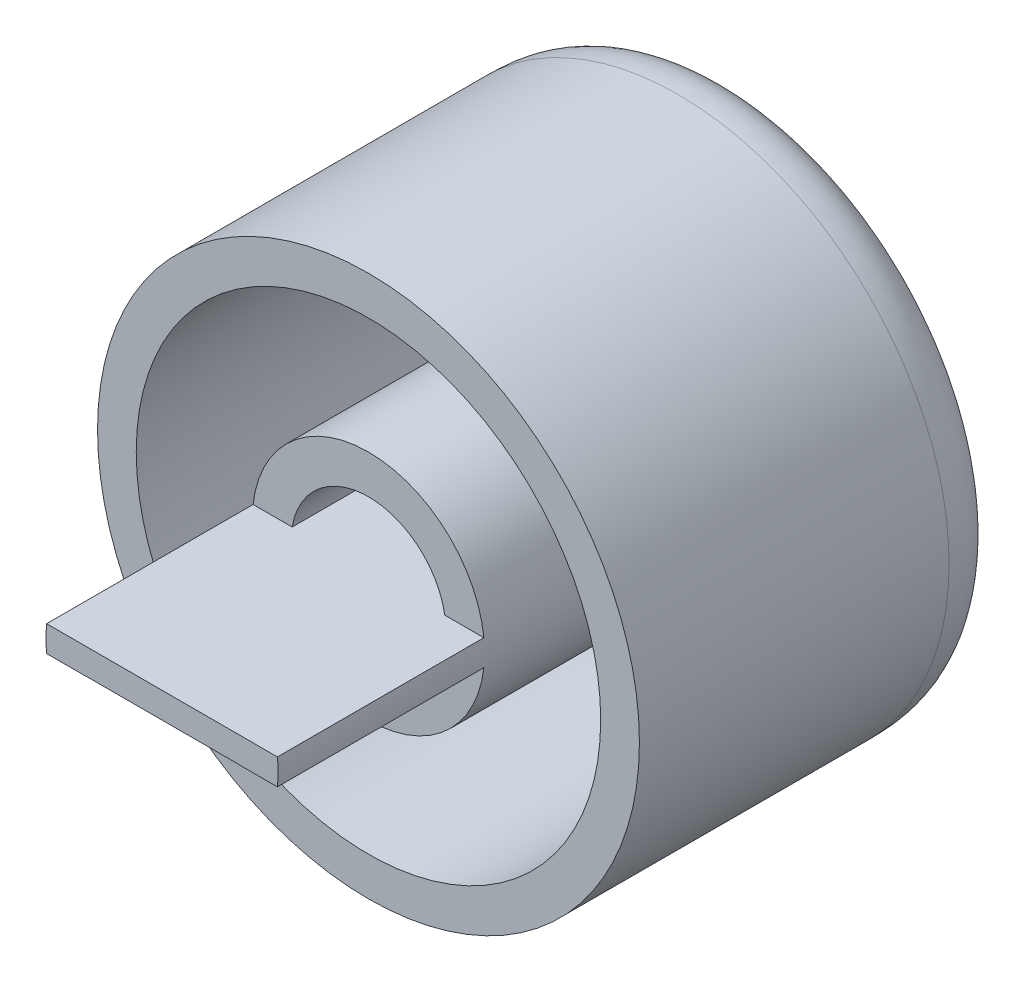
ISO-10303-21;
HEADER;
FILE_DESCRIPTION(('STEP AP214'),'2;1');
FILE_NAME('part.step','',(''),(''),'','','');
FILE_SCHEMA(('AUTOMOTIVE_DESIGN { 1 0 10303 214 1 1 1 1 }'));
ENDSEC;
DATA;
#1=APPLICATION_CONTEXT('core data for automotive mechanical design processes');
#2=APPLICATION_PROTOCOL_DEFINITION('international standard','automotive_design',2000,#1);
#3=PRODUCT_CONTEXT('',#1,'mechanical');
#4=PRODUCT('Part','Part','',(#3));
#5=PRODUCT_RELATED_PRODUCT_CATEGORY('part','',(#4));
#6=PRODUCT_DEFINITION_FORMATION('','',#4);
#7=PRODUCT_DEFINITION_CONTEXT('part definition',#1,'design');
#8=PRODUCT_DEFINITION('design','',#6,#7);
#9=PRODUCT_DEFINITION_SHAPE('','',#8);
#10=(LENGTH_UNIT() NAMED_UNIT(*) SI_UNIT(.MILLI.,.METRE.));
#11=(NAMED_UNIT(*) PLANE_ANGLE_UNIT() SI_UNIT($,.RADIAN.));
#12=(NAMED_UNIT(*) SI_UNIT($,.STERADIAN.) SOLID_ANGLE_UNIT());
#13=UNCERTAINTY_MEASURE_WITH_UNIT(LENGTH_MEASURE(1.E-05),#10,'distance_accuracy_value','');
#14=(GEOMETRIC_REPRESENTATION_CONTEXT(3) GLOBAL_UNCERTAINTY_ASSIGNED_CONTEXT((#13)) GLOBAL_UNIT_ASSIGNED_CONTEXT((#10,
#11,#12)) REPRESENTATION_CONTEXT('',''));
#15=CARTESIAN_POINT('',(0.,0.,0.));
#16=DIRECTION('',(0.,0.,1.));
#17=DIRECTION('',(1.,0.,0.));
#18=AXIS2_PLACEMENT_3D('',#15,#16,#17);
#19=CARTESIAN_POINT('',(0.,0.,14.));
#20=DIRECTION('',(0.,0.,1.));
#21=DIRECTION('',(1.,0.,0.));
#22=AXIS2_PLACEMENT_3D('',#19,#20,#21);
#23=PLANE('',#22);
#24=CARTESIAN_POINT('',(0.,0.,14.));
#25=DIRECTION('',(0.,0.,1.));
#26=DIRECTION('',(1.,0.,0.));
#27=AXIS2_PLACEMENT_3D('',#24,#25,#26);
#28=CIRCLE('',#27,4.5);
#29=CARTESIAN_POINT('',(-4.47184782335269,-0.502570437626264,14.));
#30=VERTEX_POINT('',#29);
#31=CARTESIAN_POINT('',(4.47184782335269,-0.502570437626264,14.));
#32=VERTEX_POINT('',#31);
#33=EDGE_CURVE('E212',#30,#32,#28,.T.);
#34=ORIENTED_EDGE('',*,*,#33,.T.);
#35=DIRECTION('',(-1.,0.,0.));
#36=VECTOR('',#35,1.);
#37=CARTESIAN_POINT('',(0.,-0.502570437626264,14.));
#38=LINE('',#37,#36);
#39=CARTESIAN_POINT('',(2.95760425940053,-0.502570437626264,14.));
#40=VERTEX_POINT('',#39);
#41=EDGE_CURVE('E149',#32,#40,#38,.T.);
#42=ORIENTED_EDGE('',*,*,#41,.T.);
#43=CARTESIAN_POINT('',(0.,0.,14.));
#44=DIRECTION('',(0.,0.,1.));
#45=DIRECTION('',(1.,0.,0.));
#46=AXIS2_PLACEMENT_3D('',#43,#44,#45);
#47=CIRCLE('',#46,3.);
#48=CARTESIAN_POINT('',(-2.95760425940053,-0.502570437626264,14.));
#49=VERTEX_POINT('',#48);
#50=EDGE_CURVE('E206',#49,#40,#47,.T.);
#51=ORIENTED_EDGE('',*,*,#50,.F.);
#52=EDGE_CURVE('E172',#49,#30,#38,.T.);
#53=ORIENTED_EDGE('',*,*,#52,.T.);
#54=EDGE_LOOP('',(#34,#42,#51,#53));
#55=FACE_BOUND('',#54,.T.);
#56=ADVANCED_FACE('F45',(#55),#23,.T.);
#57=CARTESIAN_POINT('',(4.47184782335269,0.502570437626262,14.));
#58=VERTEX_POINT('',#57);
#59=CARTESIAN_POINT('',(-4.47184782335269,0.502570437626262,14.));
#60=VERTEX_POINT('',#59);
#61=EDGE_CURVE('E208',#58,#60,#28,.T.);
#62=ORIENTED_EDGE('',*,*,#61,.T.);
#63=DIRECTION('',(1.,0.,0.));
#64=VECTOR('',#63,1.);
#65=CARTESIAN_POINT('',(0.,0.502570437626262,14.));
#66=LINE('',#65,#64);
#67=CARTESIAN_POINT('',(-2.95760425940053,0.502570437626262,14.));
#68=VERTEX_POINT('',#67);
#69=EDGE_CURVE('E176',#60,#68,#66,.T.);
#70=ORIENTED_EDGE('',*,*,#69,.T.);
#71=CARTESIAN_POINT('',(2.95760425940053,0.502570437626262,14.));
#72=VERTEX_POINT('',#71);
#73=EDGE_CURVE('E203',#72,#68,#47,.T.);
#74=ORIENTED_EDGE('',*,*,#73,.F.);
#75=EDGE_CURVE('E193',#72,#58,#66,.T.);
#76=ORIENTED_EDGE('',*,*,#75,.T.);
#77=EDGE_LOOP('',(#62,#70,#74,#76));
#78=FACE_BOUND('',#77,.T.);
#79=ADVANCED_FACE('F265',(#78),#23,.T.);
#80=CARTESIAN_POINT('',(0.,0.,2.));
#81=DIRECTION('',(0.,0.,-1.));
#82=DIRECTION('',(-1.,0.,0.));
#83=AXIS2_PLACEMENT_3D('',#80,#81,#82);
#84=CYLINDRICAL_SURFACE('',#83,10.5);
#85=CARTESIAN_POINT('',(10.5,0.,2.));
#86=CARTESIAN_POINT('',(10.5,-1.37426183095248,2.));
#87=CARTESIAN_POINT('',(9.95328465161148,-4.12278549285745,2.));
#88=CARTESIAN_POINT('',(7.61791426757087,-7.61791426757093,2.));
#89=CARTESIAN_POINT('',(4.12278549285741,-9.95328465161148,2.));
#90=CARTESIAN_POINT('',(0.,-10.7733576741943,2.));
#91=CARTESIAN_POINT('',(-4.12278549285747,-9.95328465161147,2.));
#92=CARTESIAN_POINT('',(-7.61791426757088,-7.61791426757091,2.));
#93=CARTESIAN_POINT('',(-9.9532846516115,-4.12278549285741,2.));
#94=CARTESIAN_POINT('',(-10.7733576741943,0.,2.));
#95=CARTESIAN_POINT('',(-9.95328465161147,4.12278549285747,2.));
#96=CARTESIAN_POINT('',(-7.6179142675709,7.61791426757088,2.));
#97=CARTESIAN_POINT('',(-4.12278549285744,9.95328465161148,2.));
#98=CARTESIAN_POINT('',(0.,10.7733576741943,2.));
#99=CARTESIAN_POINT('',(4.12278549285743,9.95328465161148,2.));
#100=CARTESIAN_POINT('',(7.6179142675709,7.61791426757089,2.));
#101=CARTESIAN_POINT('',(9.95328465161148,4.12278549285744,2.));
#102=CARTESIAN_POINT('',(10.5,1.37426183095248,2.));
#103=CARTESIAN_POINT('',(10.5,0.,2.));
#104=B_SPLINE_CURVE_WITH_KNOTS('',3,(#85,#86,#87,#88,#89,#90,#91,#92,#93,#94,#95,#96,#97,#98,
#99,#100,#101,#102,#103),.UNSPECIFIED.,.T.,.F.,(4,1,1,1,1,1,1,1,1,1,1,1,1,1,1,1,4),(0.,
0.392699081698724,0.785398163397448,1.17809724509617,1.5707963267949,1.96349540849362,
2.35619449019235,2.74889357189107,3.14159265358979,3.53429173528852,3.92699081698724,
4.31968989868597,4.71238898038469,5.10508806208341,5.49778714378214,5.89048622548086,
6.28318530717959),.UNSPECIFIED.);
#105=CARTESIAN_POINT('',(10.5,0.,2.));
#106=VERTEX_POINT('',#105);
#107=EDGE_CURVE('E246',#106,#106,#104,.F.);
#108=ORIENTED_EDGE('',*,*,#107,.T.);
#109=EDGE_LOOP('',(#108));
#110=FACE_BOUND('',#109,.T.);
#111=CARTESIAN_POINT('',(0.,0.,14.));
#112=DIRECTION('',(0.,0.,1.));
#113=DIRECTION('',(1.,0.,0.));
#114=AXIS2_PLACEMENT_3D('',#111,#112,#113);
#115=CIRCLE('',#114,10.5);
#116=CARTESIAN_POINT('',(10.5,0.,14.));
#117=VERTEX_POINT('',#116);
#118=EDGE_CURVE('E236',#117,#117,#115,.T.);
#119=ORIENTED_EDGE('',*,*,#118,.F.);
#120=EDGE_LOOP('',(#119));
#121=FACE_BOUND('',#120,.T.);
#122=ADVANCED_FACE('F255',(#110,#121),#84,.T.);
#123=CARTESIAN_POINT('',(0.,0.,0.));
#124=DIRECTION('',(0.,0.,1.));
#125=DIRECTION('',(1.,0.,0.));
#126=AXIS2_PLACEMENT_3D('',#123,#124,#125);
#127=PLANE('',#126);
#128=CARTESIAN_POINT('',(8.5,0.,0.));
#129=CARTESIAN_POINT('',(8.5,1.11249767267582,0.));
#130=CARTESIAN_POINT('',(8.05742090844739,3.33749301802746,0.));
#131=CARTESIAN_POINT('',(6.16688297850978,6.16688297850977,0.));
#132=CARTESIAN_POINT('',(3.33749301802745,8.05742090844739,0.));
#133=CARTESIAN_POINT('',(0.,8.72128954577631,0.));
#134=CARTESIAN_POINT('',(-3.33749301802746,8.05742090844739,0.));
#135=CARTESIAN_POINT('',(-6.16688297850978,6.16688297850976,0.));
#136=CARTESIAN_POINT('',(-8.05742090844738,3.33749301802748,0.));
#137=CARTESIAN_POINT('',(-8.72128954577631,0.,0.));
#138=CARTESIAN_POINT('',(-8.0574209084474,-3.33749301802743,0.));
#139=CARTESIAN_POINT('',(-6.16688297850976,-6.16688297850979,0.));
#140=CARTESIAN_POINT('',(-3.33749301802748,-8.05742090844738,0.));
#141=CARTESIAN_POINT('',(0.,-8.72128954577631,0.));
#142=CARTESIAN_POINT('',(3.33749301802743,-8.05742090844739,0.));
#143=CARTESIAN_POINT('',(6.16688297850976,-6.1668829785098,0.));
#144=CARTESIAN_POINT('',(8.05742090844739,-3.33749301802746,0.));
#145=CARTESIAN_POINT('',(8.5,-1.11249767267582,0.));
#146=CARTESIAN_POINT('',(8.5,0.,0.));
#147=B_SPLINE_CURVE_WITH_KNOTS('',3,(#128,#129,#130,#131,#132,#133,#134,#135,#136,#137,#138,
#139,#140,#141,#142,#143,#144,#145,#146),.UNSPECIFIED.,.T.,.F.,(4,1,1,1,1,1,1,1,1,1,1,1,1,1,1,1,
4),(0.,0.392699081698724,0.785398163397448,1.17809724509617,1.5707963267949,1.96349540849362,
2.35619449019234,2.74889357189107,3.14159265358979,3.53429173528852,3.92699081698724,
4.31968989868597,4.71238898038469,5.10508806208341,5.49778714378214,5.89048622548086,
6.28318530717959),.UNSPECIFIED.);
#148=CARTESIAN_POINT('',(-0.618209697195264,-8.47769312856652,0.));
#149=VERTEX_POINT('',#148);
#150=CARTESIAN_POINT('',(0.61830615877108,-8.477657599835,0.));
#151=VERTEX_POINT('',#150);
#152=EDGE_CURVE('E306',#149,#151,#147,.F.);
#153=ORIENTED_EDGE('',*,*,#152,.T.);
#154=CARTESIAN_POINT('',(-1.49999999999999,-7.11194814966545,0.));
#155=CARTESIAN_POINT('',(-1.49999999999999,-6.72014233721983,0.));
#156=CARTESIAN_POINT('',(-1.17541743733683,-5.93653071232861,0.));
#157=CARTESIAN_POINT('',(0.,-5.44965686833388,0.));
#158=CARTESIAN_POINT('',(1.17541743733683,-5.93653071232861,0.));
#159=CARTESIAN_POINT('',(1.66229128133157,-7.11194814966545,0.));
#160=CARTESIAN_POINT('',(1.17541743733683,-8.28736558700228,0.));
#161=CARTESIAN_POINT('',(0.,-8.77423943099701,0.));
#162=CARTESIAN_POINT('',(-1.17541743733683,-8.28736558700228,0.));
#163=CARTESIAN_POINT('',(-1.49999999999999,-7.50375396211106,0.));
#164=CARTESIAN_POINT('',(-1.49999999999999,-7.11194814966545,0.));
#165=B_SPLINE_CURVE_WITH_KNOTS('',3,(#154,#155,#156,#157,#158,#159,#160,#161,#162,#163,#164),
.UNSPECIFIED.,.T.,.F.,(4,1,1,1,1,1,1,1,4),(-3.14159265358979,-2.35619449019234,-1.5707963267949,
-0.785398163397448,0.,0.785398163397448,1.5707963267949,2.35619449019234,3.14159265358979),.UNSPECIFIED.);
#166=EDGE_CURVE('E59',#151,#149,#165,.F.);
#167=ORIENTED_EDGE('',*,*,#166,.T.);
#168=EDGE_LOOP('',(#153,#167));
#169=FACE_BOUND('',#168,.T.);
#170=ADVANCED_FACE('F264',(#169),#127,.F.);
#171=CARTESIAN_POINT('',(0.,0.,14.));
#172=DIRECTION('',(0.,0.,-1.));
#173=DIRECTION('',(-1.,0.,0.));
#174=AXIS2_PLACEMENT_3D('',#171,#172,#173);
#175=CYLINDRICAL_SURFACE('',#174,9.);
#176=CARTESIAN_POINT('',(0.,0.,14.));
#177=DIRECTION('',(0.,0.,1.));
#178=DIRECTION('',(1.,0.,0.));
#179=AXIS2_PLACEMENT_3D('',#176,#177,#178);
#180=CIRCLE('',#179,9.);
#181=CARTESIAN_POINT('',(9.,0.,14.));
#182=VERTEX_POINT('',#181);
#183=EDGE_CURVE('E230',#182,#182,#180,.T.);
#184=ORIENTED_EDGE('',*,*,#183,.T.);
#185=EDGE_LOOP('',(#184));
#186=FACE_BOUND('',#185,.T.);
#187=CARTESIAN_POINT('',(0.,0.,2.));
#188=DIRECTION('',(0.,0.,1.));
#189=DIRECTION('',(1.,0.,0.));
#190=AXIS2_PLACEMENT_3D('',#187,#188,#189);
#191=CIRCLE('',#190,9.);
#192=CARTESIAN_POINT('',(9.,0.,2.));
#193=VERTEX_POINT('',#192);
#194=EDGE_CURVE('E239',#193,#193,#191,.F.);
#195=ORIENTED_EDGE('',*,*,#194,.T.);
#196=EDGE_LOOP('',(#195));
#197=FACE_BOUND('',#196,.T.);
#198=ADVANCED_FACE('F440',(#186,#197),#175,.F.);
#199=CARTESIAN_POINT('',(0.,0.,14.));
#200=DIRECTION('',(0.,0.,1.));
#201=DIRECTION('',(1.,0.,0.));
#202=AXIS2_PLACEMENT_3D('',#199,#200,#201);
#203=PLANE('',#202);
#204=ORIENTED_EDGE('',*,*,#183,.F.);
#205=EDGE_LOOP('',(#204));
#206=FACE_BOUND('',#205,.T.);
#207=ORIENTED_EDGE('',*,*,#118,.T.);
#208=EDGE_LOOP('',(#207));
#209=FACE_BOUND('',#208,.T.);
#210=ADVANCED_FACE('F437',(#206,#209),#203,.T.);
#211=CARTESIAN_POINT('',(0.,0.,2.));
#212=DIRECTION('',(0.,0.,1.));
#213=DIRECTION('',(1.,0.,0.));
#214=AXIS2_PLACEMENT_3D('',#211,#212,#213);
#215=PLANE('',#214);
#216=CARTESIAN_POINT('',(0.,0.,2.));
#217=DIRECTION('',(0.,0.,1.));
#218=DIRECTION('',(1.,0.,0.));
#219=AXIS2_PLACEMENT_3D('',#216,#217,#218);
#220=CIRCLE('',#219,4.5);
#221=CARTESIAN_POINT('',(4.5,0.,2.));
#222=VERTEX_POINT('',#221);
#223=EDGE_CURVE('E207',#222,#222,#220,.T.);
#224=ORIENTED_EDGE('',*,*,#223,.F.);
#225=EDGE_LOOP('',(#224));
#226=FACE_BOUND('',#225,.T.);
#227=ORIENTED_EDGE('',*,*,#194,.F.);
#228=EDGE_LOOP('',(#227));
#229=FACE_BOUND('',#228,.T.);
#230=ADVANCED_FACE('F432',(#226,#229),#215,.T.);
#231=CARTESIAN_POINT('',(0.,0.,14.));
#232=DIRECTION('',(0.,0.,-1.));
#233=DIRECTION('',(-1.,0.,0.));
#234=AXIS2_PLACEMENT_3D('',#231,#232,#233);
#235=CYLINDRICAL_SURFACE('',#234,3.);
#236=CARTESIAN_POINT('',(0.,0.,2.));
#237=DIRECTION('',(0.,0.,1.));
#238=DIRECTION('',(1.,0.,0.));
#239=AXIS2_PLACEMENT_3D('',#236,#237,#238);
#240=CIRCLE('',#239,3.);
#241=CARTESIAN_POINT('',(-2.95847322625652,-0.497429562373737,2.));
#242=VERTEX_POINT('',#241);
#243=CARTESIAN_POINT('',(2.95847322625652,-0.497429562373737,2.));
#244=VERTEX_POINT('',#243);
#245=EDGE_CURVE('E216',#242,#244,#240,.T.);
#246=ORIENTED_EDGE('',*,*,#245,.F.);
#247=DIRECTION('',(0.,0.,-1.));
#248=VECTOR('',#247,1.);
#249=CARTESIAN_POINT('',(-2.95847322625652,-0.497429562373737,14.));
#250=LINE('',#249,#248);
#251=CARTESIAN_POINT('',(-2.95847322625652,-0.497429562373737,22.));
#252=VERTEX_POINT('',#251);
#253=EDGE_CURVE('E226',#252,#242,#250,.T.);
#254=ORIENTED_EDGE('',*,*,#253,.F.);
#255=CARTESIAN_POINT('',(0.,0.,22.));
#256=DIRECTION('',(0.,0.,1.));
#257=DIRECTION('',(1.,0.,0.));
#258=AXIS2_PLACEMENT_3D('',#255,#256,#257);
#259=CIRCLE('',#258,3.);
#260=CARTESIAN_POINT('',(-2.95760425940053,-0.502570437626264,22.));
#261=VERTEX_POINT('',#260);
#262=EDGE_CURVE('E180',#261,#252,#259,.F.);
#263=ORIENTED_EDGE('',*,*,#262,.F.);
#264=DIRECTION('',(0.,0.,-1.));
#265=VECTOR('',#264,1.);
#266=CARTESIAN_POINT('',(-2.95760425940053,-0.502570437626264,22.));
#267=LINE('',#266,#265);
#268=EDGE_CURVE('E196',#261,#49,#267,.T.);
#269=ORIENTED_EDGE('',*,*,#268,.T.);
#270=ORIENTED_EDGE('',*,*,#50,.T.);
#271=DIRECTION('',(0.,0.,-1.));
#272=VECTOR('',#271,1.);
#273=CARTESIAN_POINT('',(2.95760425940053,-0.502570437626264,22.));
#274=LINE('',#273,#272);
#275=CARTESIAN_POINT('',(2.95760425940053,-0.502570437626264,22.));
#276=VERTEX_POINT('',#275);
#277=EDGE_CURVE('E194',#276,#40,#274,.T.);
#278=ORIENTED_EDGE('',*,*,#277,.F.);
#279=CARTESIAN_POINT('',(2.95847322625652,-0.497429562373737,22.));
#280=VERTEX_POINT('',#279);
#281=EDGE_CURVE('E170',#280,#276,#259,.F.);
#282=ORIENTED_EDGE('',*,*,#281,.F.);
#283=DIRECTION('',(0.,0.,-1.));
#284=VECTOR('',#283,1.);
#285=CARTESIAN_POINT('',(2.95847322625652,-0.497429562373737,14.));
#286=LINE('',#285,#284);
#287=EDGE_CURVE('E224',#280,#244,#286,.T.);
#288=ORIENTED_EDGE('',*,*,#287,.T.);
#289=EDGE_LOOP('',(#246,#254,#263,#269,#270,#278,#282,#288));
#290=FACE_BOUND('',#289,.T.);
#291=ADVANCED_FACE('F429',(#290),#235,.F.);
#292=CARTESIAN_POINT('',(2.95760425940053,0.502570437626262,2.));
#293=VERTEX_POINT('',#292);
#294=CARTESIAN_POINT('',(-2.95760425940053,0.502570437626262,2.));
#295=VERTEX_POINT('',#294);
#296=EDGE_CURVE('E153',#293,#295,#240,.T.);
#297=ORIENTED_EDGE('',*,*,#296,.F.);
#298=DIRECTION('',(0.,0.,-1.));
#299=VECTOR('',#298,1.);
#300=CARTESIAN_POINT('',(2.95760425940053,0.502570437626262,14.));
#301=LINE('',#300,#299);
#302=EDGE_CURVE('E227',#72,#293,#301,.T.);
#303=ORIENTED_EDGE('',*,*,#302,.F.);
#304=ORIENTED_EDGE('',*,*,#73,.T.);
#305=DIRECTION('',(0.,0.,-1.));
#306=VECTOR('',#305,1.);
#307=CARTESIAN_POINT('',(-2.95760425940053,0.502570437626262,14.));
#308=LINE('',#307,#306);
#309=EDGE_CURVE('E211',#68,#295,#308,.T.);
#310=ORIENTED_EDGE('',*,*,#309,.T.);
#311=EDGE_LOOP('',(#297,#303,#304,#310));
#312=FACE_BOUND('',#311,.T.);
#313=ADVANCED_FACE('F427',(#312),#235,.F.);
#314=CARTESIAN_POINT('',(0.,-0.497429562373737,14.));
#315=DIRECTION('',(0.,1.,0.));
#316=DIRECTION('',(0.,0.,1.));
#317=AXIS2_PLACEMENT_3D('',#314,#315,#316);
#318=PLANE('',#317);
#319=DIRECTION('',(1.,0.,0.));
#320=VECTOR('',#319,1.);
#321=CARTESIAN_POINT('',(0.,-0.497429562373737,2.));
#322=LINE('',#321,#320);
#323=EDGE_CURVE('E219',#242,#244,#322,.T.);
#324=ORIENTED_EDGE('',*,*,#323,.T.);
#325=ORIENTED_EDGE('',*,*,#287,.F.);
#326=DIRECTION('',(1.,0.,0.));
#327=VECTOR('',#326,1.);
#328=CARTESIAN_POINT('',(0.,-0.497429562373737,22.));
#329=LINE('',#328,#327);
#330=EDGE_CURVE('E184',#252,#280,#329,.T.);
#331=ORIENTED_EDGE('',*,*,#330,.F.);
#332=ORIENTED_EDGE('',*,*,#253,.T.);
#333=EDGE_LOOP('',(#324,#325,#331,#332));
#334=FACE_BOUND('',#333,.T.);
#335=ADVANCED_FACE('F424',(#334),#318,.F.);
#336=CARTESIAN_POINT('',(0.,0.502570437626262,14.));
#337=DIRECTION('',(0.,-1.,0.));
#338=DIRECTION('',(0.,0.,-1.));
#339=AXIS2_PLACEMENT_3D('',#336,#337,#338);
#340=PLANE('',#339);
#341=DIRECTION('',(-1.,0.,0.));
#342=VECTOR('',#341,1.);
#343=CARTESIAN_POINT('',(0.,0.502570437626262,2.));
#344=LINE('',#343,#342);
#345=EDGE_CURVE('E215',#293,#295,#344,.T.);
#346=ORIENTED_EDGE('',*,*,#345,.T.);
#347=ORIENTED_EDGE('',*,*,#309,.F.);
#348=ORIENTED_EDGE('',*,*,#69,.F.);
#349=DIRECTION('',(0.,0.,-1.));
#350=VECTOR('',#349,1.);
#351=CARTESIAN_POINT('',(-4.47184782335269,0.502570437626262,22.));
#352=LINE('',#351,#350);
#353=CARTESIAN_POINT('',(-4.47184782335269,0.502570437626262,22.));
#354=VERTEX_POINT('',#353);
#355=EDGE_CURVE('E200',#354,#60,#352,.T.);
#356=ORIENTED_EDGE('',*,*,#355,.F.);
#357=DIRECTION('',(1.,0.,0.));
#358=VECTOR('',#357,1.);
#359=CARTESIAN_POINT('',(0.,0.502570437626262,22.));
#360=LINE('',#359,#358);
#361=CARTESIAN_POINT('',(4.47184782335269,0.502570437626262,22.));
#362=VERTEX_POINT('',#361);
#363=EDGE_CURVE('E164',#354,#362,#360,.T.);
#364=ORIENTED_EDGE('',*,*,#363,.T.);
#365=DIRECTION('',(0.,0.,-1.));
#366=VECTOR('',#365,1.);
#367=CARTESIAN_POINT('',(4.47184782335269,0.502570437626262,22.));
#368=LINE('',#367,#366);
#369=EDGE_CURVE('E154',#362,#58,#368,.T.);
#370=ORIENTED_EDGE('',*,*,#369,.T.);
#371=ORIENTED_EDGE('',*,*,#75,.F.);
#372=ORIENTED_EDGE('',*,*,#302,.T.);
#373=EDGE_LOOP('',(#346,#347,#348,#356,#364,#370,#371,#372));
#374=FACE_BOUND('',#373,.T.);
#375=ADVANCED_FACE('F423',(#374),#340,.F.);
#376=CARTESIAN_POINT('',(0.,0.,14.));
#377=DIRECTION('',(0.,0.,-1.));
#378=DIRECTION('',(-1.,0.,0.));
#379=AXIS2_PLACEMENT_3D('',#376,#377,#378);
#380=CYLINDRICAL_SURFACE('',#379,4.5);
#381=ORIENTED_EDGE('',*,*,#61,.F.);
#382=ORIENTED_EDGE('',*,*,#369,.F.);
#383=CARTESIAN_POINT('',(0.,0.,22.));
#384=DIRECTION('',(0.,0.,1.));
#385=DIRECTION('',(1.,0.,0.));
#386=AXIS2_PLACEMENT_3D('',#383,#384,#385);
#387=CIRCLE('',#386,4.5);
#388=CARTESIAN_POINT('',(4.47184782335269,-0.502570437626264,22.));
#389=VERTEX_POINT('',#388);
#390=EDGE_CURVE('E157',#389,#362,#387,.T.);
#391=ORIENTED_EDGE('',*,*,#390,.F.);
#392=DIRECTION('',(0.,0.,-1.));
#393=VECTOR('',#392,1.);
#394=CARTESIAN_POINT('',(4.47184782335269,-0.502570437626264,22.));
#395=LINE('',#394,#393);
#396=EDGE_CURVE('E143',#389,#32,#395,.T.);
#397=ORIENTED_EDGE('',*,*,#396,.T.);
#398=ORIENTED_EDGE('',*,*,#33,.F.);
#399=DIRECTION('',(0.,0.,-1.));
#400=VECTOR('',#399,1.);
#401=CARTESIAN_POINT('',(-4.47184782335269,-0.502570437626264,22.));
#402=LINE('',#401,#400);
#403=CARTESIAN_POINT('',(-4.47184782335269,-0.502570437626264,22.));
#404=VERTEX_POINT('',#403);
#405=EDGE_CURVE('E198',#404,#30,#402,.T.);
#406=ORIENTED_EDGE('',*,*,#405,.F.);
#407=EDGE_CURVE('E166',#354,#404,#387,.T.);
#408=ORIENTED_EDGE('',*,*,#407,.F.);
#409=ORIENTED_EDGE('',*,*,#355,.T.);
#410=EDGE_LOOP('',(#381,#382,#391,#397,#398,#406,#408,#409));
#411=FACE_BOUND('',#410,.T.);
#412=ORIENTED_EDGE('',*,*,#223,.T.);
#413=EDGE_LOOP('',(#412));
#414=FACE_BOUND('',#413,.T.);
#415=ADVANCED_FACE('F159',(#411,#414),#380,.T.);
#416=ORIENTED_EDGE('',*,*,#296,.T.);
#417=ORIENTED_EDGE('',*,*,#345,.F.);
#418=EDGE_LOOP('',(#416,#417));
#419=FACE_BOUND('',#418,.T.);
#420=ADVANCED_FACE('F422',(#419),#215,.T.);
#421=ORIENTED_EDGE('',*,*,#245,.T.);
#422=ORIENTED_EDGE('',*,*,#323,.F.);
#423=EDGE_LOOP('',(#421,#422));
#424=FACE_BOUND('',#423,.T.);
#425=ADVANCED_FACE('F446',(#424),#215,.T.);
#426=CARTESIAN_POINT('',(0.,-0.502570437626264,22.));
#427=DIRECTION('',(0.,-1.,0.));
#428=DIRECTION('',(0.,0.,-1.));
#429=AXIS2_PLACEMENT_3D('',#426,#427,#428);
#430=PLANE('',#429);
#431=ORIENTED_EDGE('',*,*,#41,.F.);
#432=ORIENTED_EDGE('',*,*,#396,.F.);
#433=DIRECTION('',(-1.,0.,0.));
#434=VECTOR('',#433,1.);
#435=CARTESIAN_POINT('',(0.,-0.502570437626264,22.));
#436=LINE('',#435,#434);
#437=EDGE_CURVE('E147',#389,#276,#436,.T.);
#438=ORIENTED_EDGE('',*,*,#437,.T.);
#439=ORIENTED_EDGE('',*,*,#277,.T.);
#440=EDGE_LOOP('',(#431,#432,#438,#439));
#441=FACE_BOUND('',#440,.T.);
#442=ADVANCED_FACE('F145',(#441),#430,.T.);
#443=ORIENTED_EDGE('',*,*,#52,.F.);
#444=ORIENTED_EDGE('',*,*,#268,.F.);
#445=EDGE_CURVE('E174',#261,#404,#436,.T.);
#446=ORIENTED_EDGE('',*,*,#445,.T.);
#447=ORIENTED_EDGE('',*,*,#405,.T.);
#448=EDGE_LOOP('',(#443,#444,#446,#447));
#449=FACE_BOUND('',#448,.T.);
#450=ADVANCED_FACE('F414',(#449),#430,.T.);
#451=CARTESIAN_POINT('',(0.,0.,22.));
#452=DIRECTION('',(0.,0.,1.));
#453=DIRECTION('',(1.,0.,0.));
#454=AXIS2_PLACEMENT_3D('',#451,#452,#453);
#455=PLANE('',#454);
#456=ORIENTED_EDGE('',*,*,#437,.F.);
#457=ORIENTED_EDGE('',*,*,#390,.T.);
#458=ORIENTED_EDGE('',*,*,#363,.F.);
#459=ORIENTED_EDGE('',*,*,#407,.T.);
#460=ORIENTED_EDGE('',*,*,#445,.F.);
#461=ORIENTED_EDGE('',*,*,#262,.T.);
#462=ORIENTED_EDGE('',*,*,#330,.T.);
#463=ORIENTED_EDGE('',*,*,#281,.T.);
#464=EDGE_LOOP('',(#456,#457,#458,#459,#460,#461,#462,#463));
#465=FACE_BOUND('',#464,.T.);
#466=ADVANCED_FACE('F167',(#465),#455,.T.);
#467=CARTESIAN_POINT('',(10.5,0.,2.));
#468=CARTESIAN_POINT('',(10.5,1.37426183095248,2.));
#469=CARTESIAN_POINT('',(9.95328465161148,4.12278549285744,2.));
#470=CARTESIAN_POINT('',(7.6179142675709,7.61791426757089,2.));
#471=CARTESIAN_POINT('',(4.12278549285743,9.95328465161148,2.));
#472=CARTESIAN_POINT('',(0.,10.7733576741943,2.));
#473=CARTESIAN_POINT('',(-4.12278549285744,9.95328465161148,2.));
#474=CARTESIAN_POINT('',(-7.6179142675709,7.61791426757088,2.));
#475=CARTESIAN_POINT('',(-9.95328465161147,4.12278549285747,2.));
#476=CARTESIAN_POINT('',(-10.7733576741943,0.,2.));
#477=CARTESIAN_POINT('',(-9.9532846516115,-4.12278549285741,2.));
#478=CARTESIAN_POINT('',(-7.61791426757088,-7.61791426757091,2.));
#479=CARTESIAN_POINT('',(-4.12278549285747,-9.95328465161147,2.));
#480=CARTESIAN_POINT('',(0.,-10.7733576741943,2.));
#481=CARTESIAN_POINT('',(4.12278549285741,-9.95328465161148,2.));
#482=CARTESIAN_POINT('',(7.61791426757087,-7.61791426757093,2.));
#483=CARTESIAN_POINT('',(9.95328465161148,-4.12278549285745,2.));
#484=CARTESIAN_POINT('',(10.5,-1.37426183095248,2.));
#485=CARTESIAN_POINT('',(10.5,0.,2.));
#486=CARTESIAN_POINT('',(10.5,0.,1.66360389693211));
#487=CARTESIAN_POINT('',(10.5,1.37426183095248,1.66360389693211));
#488=CARTESIAN_POINT('',(9.95328465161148,4.12278549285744,1.66360389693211));
#489=CARTESIAN_POINT('',(7.6179142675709,7.61791426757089,1.66360389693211));
#490=CARTESIAN_POINT('',(4.12278549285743,9.95328465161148,1.66360389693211));
#491=CARTESIAN_POINT('',(0.,10.7733576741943,1.66360389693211));
#492=CARTESIAN_POINT('',(-4.12278549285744,9.95328465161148,1.66360389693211));
#493=CARTESIAN_POINT('',(-7.6179142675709,7.61791426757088,1.66360389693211));
#494=CARTESIAN_POINT('',(-9.95328465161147,4.12278549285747,1.66360389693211));
#495=CARTESIAN_POINT('',(-10.7733576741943,0.,1.66360389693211));
#496=CARTESIAN_POINT('',(-9.9532846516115,-4.12278549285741,1.66360389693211));
#497=CARTESIAN_POINT('',(-7.61791426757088,-7.61791426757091,1.66360389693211));
#498=CARTESIAN_POINT('',(-4.12278549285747,-9.95328465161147,1.66360389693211));
#499=CARTESIAN_POINT('',(0.,-10.7733576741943,1.66360389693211));
#500=CARTESIAN_POINT('',(4.12278549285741,-9.95328465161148,1.66360389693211));
#501=CARTESIAN_POINT('',(7.61791426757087,-7.61791426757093,1.66360389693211));
#502=CARTESIAN_POINT('',(9.95328465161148,-4.12278549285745,1.66360389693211));
#503=CARTESIAN_POINT('',(10.5,-1.37426183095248,1.66360389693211));
#504=CARTESIAN_POINT('',(10.5,0.,1.66360389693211));
#505=CARTESIAN_POINT('',(10.5,0.,1.32720779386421));
#506=CARTESIAN_POINT('',(10.5,1.37426183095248,1.32720779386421));
#507=CARTESIAN_POINT('',(9.95328465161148,4.12278549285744,1.32720779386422));
#508=CARTESIAN_POINT('',(7.6179142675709,7.61791426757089,1.32720779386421));
#509=CARTESIAN_POINT('',(4.12278549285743,9.95328465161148,1.32720779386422));
#510=CARTESIAN_POINT('',(0.,10.7733576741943,1.32720779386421));
#511=CARTESIAN_POINT('',(-4.12278549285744,9.95328465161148,1.32720779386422));
#512=CARTESIAN_POINT('',(-7.6179142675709,7.61791426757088,1.32720779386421));
#513=CARTESIAN_POINT('',(-9.95328465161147,4.12278549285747,1.32720779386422));
#514=CARTESIAN_POINT('',(-10.7733576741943,0.,1.32720779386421));
#515=CARTESIAN_POINT('',(-9.9532846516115,-4.12278549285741,1.32720779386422));
#516=CARTESIAN_POINT('',(-7.61791426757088,-7.61791426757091,1.32720779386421));
#517=CARTESIAN_POINT('',(-4.12278549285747,-9.95328465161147,1.32720779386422));
#518=CARTESIAN_POINT('',(0.,-10.7733576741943,1.32720779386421));
#519=CARTESIAN_POINT('',(4.12278549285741,-9.95328465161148,1.32720779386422));
#520=CARTESIAN_POINT('',(7.61791426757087,-7.61791426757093,1.32720779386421));
#521=CARTESIAN_POINT('',(9.95328465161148,-4.12278549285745,1.32720779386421));
#522=CARTESIAN_POINT('',(10.5,-1.37426183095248,1.32720779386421));
#523=CARTESIAN_POINT('',(10.5,0.,1.32720779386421));
#524=CARTESIAN_POINT('',(10.3566161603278,0.,0.585786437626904));
#525=CARTESIAN_POINT('',(10.3566161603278,1.35549545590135,0.585786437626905));
#526=CARTESIAN_POINT('',(9.81736654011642,4.06648636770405,0.585786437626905));
#527=CARTESIAN_POINT('',(7.51388704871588,7.51388704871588,0.585786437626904));
#528=CARTESIAN_POINT('',(4.06648636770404,9.81736654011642,0.585786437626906));
#529=CARTESIAN_POINT('',(0.,10.6262409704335,0.585786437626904));
#530=CARTESIAN_POINT('',(-4.06648636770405,9.81736654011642,0.585786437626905));
#531=CARTESIAN_POINT('',(-7.51388704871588,7.51388704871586,0.585786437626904));
#532=CARTESIAN_POINT('',(-9.81736654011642,4.06648636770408,0.585786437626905));
#533=CARTESIAN_POINT('',(-10.6262409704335,0.,0.585786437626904));
#534=CARTESIAN_POINT('',(-9.81736654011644,-4.06648636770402,0.585786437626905));
#535=CARTESIAN_POINT('',(-7.51388704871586,-7.5138870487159,0.585786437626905));
#536=CARTESIAN_POINT('',(-4.06648636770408,-9.81736654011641,0.585786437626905));
#537=CARTESIAN_POINT('',(0.,-10.6262409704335,0.585786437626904));
#538=CARTESIAN_POINT('',(4.06648636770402,-9.81736654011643,0.585786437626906));
#539=CARTESIAN_POINT('',(7.51388704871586,-7.51388704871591,0.585786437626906));
#540=CARTESIAN_POINT('',(9.81736654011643,-4.06648636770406,0.585786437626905));
#541=CARTESIAN_POINT('',(10.3566161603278,-1.35549545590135,0.585786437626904));
#542=CARTESIAN_POINT('',(10.3566161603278,0.,0.585786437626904));
#543=CARTESIAN_POINT('',(9.9142135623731,0.,0.143383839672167));
#544=CARTESIAN_POINT('',(9.9142135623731,1.29759288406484,0.143383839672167));
#545=CARTESIAN_POINT('',(9.39799901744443,3.89277865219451,0.143383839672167));
#546=CARTESIAN_POINT('',(7.19291704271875,7.19291704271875,0.143383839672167));
#547=CARTESIAN_POINT('',(3.8927786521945,9.39799901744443,0.143383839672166));
#548=CARTESIAN_POINT('',(0.,10.1723208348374,0.143383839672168));
#549=CARTESIAN_POINT('',(-3.8927786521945,9.39799901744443,0.143383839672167));
#550=CARTESIAN_POINT('',(-7.19291704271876,7.19291704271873,0.143383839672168));
#551=CARTESIAN_POINT('',(-9.39799901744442,3.89277865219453,0.143383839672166));
#552=CARTESIAN_POINT('',(-10.1723208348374,0.,0.143383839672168));
#553=CARTESIAN_POINT('',(-9.39799901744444,-3.89277865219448,0.143383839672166));
#554=CARTESIAN_POINT('',(-7.19291704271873,-7.19291704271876,0.143383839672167));
#555=CARTESIAN_POINT('',(-3.89277865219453,-9.39799901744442,0.143383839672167));
#556=CARTESIAN_POINT('',(0.,-10.1723208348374,0.143383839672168));
#557=CARTESIAN_POINT('',(3.89277865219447,-9.39799901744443,0.143383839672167));
#558=CARTESIAN_POINT('',(7.19291704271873,-7.19291704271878,0.143383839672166));
#559=CARTESIAN_POINT('',(9.39799901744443,-3.89277865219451,0.143383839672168));
#560=CARTESIAN_POINT('',(9.9142135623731,-1.29759288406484,0.143383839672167));
#561=CARTESIAN_POINT('',(9.9142135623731,0.,0.143383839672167));
#562=CARTESIAN_POINT('',(9.17279220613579,0.,0.));
#563=CARTESIAN_POINT('',(9.17279220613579,1.20055411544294,0.));
#564=CARTESIAN_POINT('',(8.6951820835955,3.6016623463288,0.));
#565=CARTESIAN_POINT('',(6.65500424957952,6.65500424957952,0.));
#566=CARTESIAN_POINT('',(3.60166234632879,8.6951820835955,0.));
#567=CARTESIAN_POINT('',(0.,9.41159726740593,0.));
#568=CARTESIAN_POINT('',(-3.60166234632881,8.6951820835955,0.));
#569=CARTESIAN_POINT('',(-6.65500424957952,6.6550042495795,0.));
#570=CARTESIAN_POINT('',(-8.69518208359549,3.60166234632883,0.));
#571=CARTESIAN_POINT('',(-9.41159726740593,0.,0.));
#572=CARTESIAN_POINT('',(-8.69518208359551,-3.60166234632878,0.));
#573=CARTESIAN_POINT('',(-6.6550042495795,-6.65500424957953,0.));
#574=CARTESIAN_POINT('',(-3.60166234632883,-8.69518208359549,0.));
#575=CARTESIAN_POINT('',(0.,-9.41159726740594,0.));
#576=CARTESIAN_POINT('',(3.60166234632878,-8.6951820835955,0.));
#577=CARTESIAN_POINT('',(6.6550042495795,-6.65500424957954,0.));
#578=CARTESIAN_POINT('',(8.6951820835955,-3.60166234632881,0.));
#579=CARTESIAN_POINT('',(9.17279220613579,-1.20055411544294,0.));
#580=CARTESIAN_POINT('',(9.17279220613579,0.,0.));
#581=CARTESIAN_POINT('',(8.8363961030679,0.,0.));
#582=CARTESIAN_POINT('',(8.8363961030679,1.15652589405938,0.));
#583=CARTESIAN_POINT('',(8.37630149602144,3.46957768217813,0.));
#584=CARTESIAN_POINT('',(6.41094361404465,6.41094361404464,0.));
#585=CARTESIAN_POINT('',(3.46957768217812,8.37630149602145,0.));
#586=CARTESIAN_POINT('',(0.,9.06644340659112,0.));
#587=CARTESIAN_POINT('',(-3.46957768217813,8.37630149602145,0.));
#588=CARTESIAN_POINT('',(-6.41094361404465,6.41094361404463,0.));
#589=CARTESIAN_POINT('',(-8.37630149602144,3.46957768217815,0.));
#590=CARTESIAN_POINT('',(-9.06644340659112,0.,0.));
#591=CARTESIAN_POINT('',(-8.37630149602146,-3.4695776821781,0.));
#592=CARTESIAN_POINT('',(-6.41094361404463,-6.41094361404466,0.));
#593=CARTESIAN_POINT('',(-3.46957768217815,-8.37630149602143,0.));
#594=CARTESIAN_POINT('',(0.,-9.06644340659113,0.));
#595=CARTESIAN_POINT('',(3.4695776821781,-8.37630149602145,0.));
#596=CARTESIAN_POINT('',(6.41094361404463,-6.41094361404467,0.));
#597=CARTESIAN_POINT('',(8.37630149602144,-3.46957768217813,0.));
#598=CARTESIAN_POINT('',(8.8363961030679,-1.15652589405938,0.));
#599=CARTESIAN_POINT('',(8.8363961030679,0.,0.));
#600=CARTESIAN_POINT('',(8.5,0.,0.));
#601=CARTESIAN_POINT('',(8.5,1.11249767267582,0.));
#602=CARTESIAN_POINT('',(8.05742090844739,3.33749301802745,0.));
#603=CARTESIAN_POINT('',(6.16688297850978,6.16688297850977,0.));
#604=CARTESIAN_POINT('',(3.33749301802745,8.05742090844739,0.));
#605=CARTESIAN_POINT('',(0.,8.72128954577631,0.));
#606=CARTESIAN_POINT('',(-3.33749301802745,8.05742090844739,0.));
#607=CARTESIAN_POINT('',(-6.16688297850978,6.16688297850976,0.));
#608=CARTESIAN_POINT('',(-8.05742090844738,3.33749301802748,0.));
#609=CARTESIAN_POINT('',(-8.72128954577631,0.,0.));
#610=CARTESIAN_POINT('',(-8.0574209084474,-3.33749301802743,0.));
#611=CARTESIAN_POINT('',(-6.16688297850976,-6.16688297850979,0.));
#612=CARTESIAN_POINT('',(-3.33749301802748,-8.05742090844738,0.));
#613=CARTESIAN_POINT('',(0.,-8.72128954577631,0.));
#614=CARTESIAN_POINT('',(3.33749301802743,-8.05742090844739,0.));
#615=CARTESIAN_POINT('',(6.16688297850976,-6.1668829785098,0.));
#616=CARTESIAN_POINT('',(8.05742090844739,-3.33749301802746,0.));
#617=CARTESIAN_POINT('',(8.5,-1.11249767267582,0.));
#618=CARTESIAN_POINT('',(8.5,0.,0.));
#619=B_SPLINE_SURFACE_WITH_KNOTS('',5,3,((#467,#468,#469,#470,#471,#472,#473,#474,#475,#476,
#477,#478,#479,#480,#481,#482,#483,#484,#485),(#486,#487,#488,#489,#490,#491,#492,#493,#494,
#495,#496,#497,#498,#499,#500,#501,#502,#503,#504),(#505,#506,#507,#508,#509,#510,#511,#512,
#513,#514,#515,#516,#517,#518,#519,#520,#521,#522,#523),(#524,#525,#526,#527,#528,#529,#530,
#531,#532,#533,#534,#535,#536,#537,#538,#539,#540,#541,#542),(#543,#544,#545,#546,#547,#548,
#549,#550,#551,#552,#553,#554,#555,#556,#557,#558,#559,#560,#561),(#562,#563,#564,#565,#566,
#567,#568,#569,#570,#571,#572,#573,#574,#575,#576,#577,#578,#579,#580),(#581,#582,#583,#584,
#585,#586,#587,#588,#589,#590,#591,#592,#593,#594,#595,#596,#597,#598,#599),(#600,#601,#602,
#603,#604,#605,#606,#607,#608,#609,#610,#611,#612,#613,#614,#615,#616,#617,#618)),.UNSPECIFIED.,
.F.,.T.,.F.,(6,2,6),(4,1,1,1,1,1,1,1,1,1,1,1,1,1,1,1,4),(0.,0.5,1.),(0.,0.392699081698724,
0.785398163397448,1.17809724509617,1.5707963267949,1.96349540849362,2.35619449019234,
2.74889357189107,3.14159265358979,3.53429173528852,3.92699081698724,4.31968989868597,
4.71238898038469,5.10508806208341,5.49778714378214,5.89048622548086,6.28318530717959),.UNSPECIFIED.);
#620=CARTESIAN_POINT('',(-0.621731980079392,-8.47703032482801,0.));
#621=CARTESIAN_POINT('',(-0.597629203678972,-8.48800969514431,-6.10895777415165E-07));
#622=CARTESIAN_POINT('',(-0.573233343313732,-8.49834637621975,1.97412621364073E-08));
#623=CARTESIAN_POINT('',(-0.523981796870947,-8.51767919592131,5.14355951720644E-06));
#624=CARTESIAN_POINT('',(-0.499127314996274,-8.52667840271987,9.62773511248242E-06));
#625=CARTESIAN_POINT('',(-0.448988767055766,-8.54332697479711,2.38176081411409E-05));
#626=CARTESIAN_POINT('',(-0.423705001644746,-8.55097724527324,3.35197862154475E-05));
#627=CARTESIAN_POINT('',(-0.372739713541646,-8.56492018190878,5.65219171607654E-05));
#628=CARTESIAN_POINT('',(-0.347057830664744,-8.57121153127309,6.98253317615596E-05));
#629=CARTESIAN_POINT('',(-0.295328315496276,-8.582428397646,9.75968615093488E-05));
#630=CARTESIAN_POINT('',(-0.269279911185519,-8.58735035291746,0.000112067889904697));
#631=CARTESIAN_POINT('',(-0.216849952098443,-8.59582075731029,0.000139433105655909));
#632=CARTESIAN_POINT('',(-0.190467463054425,-8.59936341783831,0.000152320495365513));
#633=CARTESIAN_POINT('',(-0.137402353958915,-8.60506808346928,0.000174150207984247));
#634=CARTESIAN_POINT('',(-0.110718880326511,-8.60722213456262,0.00018306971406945));
#635=CARTESIAN_POINT('',(-0.0570855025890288,-8.61014333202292,0.000195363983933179));
#636=CARTESIAN_POINT('',(-0.0301350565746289,-8.61090046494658,0.000198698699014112));
#637=CARTESIAN_POINT('',(0.0237587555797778,-8.61102119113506,0.000199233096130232));
#638=CARTESIAN_POINT('',(0.0507021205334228,-8.61038531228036,0.000196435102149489));
#639=CARTESIAN_POINT('',(0.104325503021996,-8.60770534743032,0.00018511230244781));
#640=CARTESIAN_POINT('',(0.131006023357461,-8.60567139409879,0.000176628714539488));
#641=CARTESIAN_POINT('',(0.184069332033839,-8.60020578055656,0.000155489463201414));
#642=CARTESIAN_POINT('',(0.210452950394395,-8.5967821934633,0.000142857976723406));
#643=CARTESIAN_POINT('',(0.262889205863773,-8.58854862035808,0.000115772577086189));
#644=CARTESIAN_POINT('',(0.28894276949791,-8.58374454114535,0.000101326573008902));
#645=CARTESIAN_POINT('',(0.340686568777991,-8.57276204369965,7.3366975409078E-05));
#646=CARTESIAN_POINT('',(0.366377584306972,-8.56658730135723,5.9851012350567E-05));
#647=CARTESIAN_POINT('',(0.417365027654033,-8.55287613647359,3.62414235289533E-05));
#648=CARTESIAN_POINT('',(0.44266183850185,-8.54534113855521,2.61442487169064E-05));
#649=CARTESIAN_POINT('',(0.49283029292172,-8.52892164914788,1.1106308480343E-05));
#650=CARTESIAN_POINT('',(0.517701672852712,-8.52003635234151,6.16863411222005E-06));
#651=CARTESIAN_POINT('',(0.566990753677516,-8.5009299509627,3.27615932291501E-07));
#652=CARTESIAN_POINT('',(0.591407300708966,-8.49070586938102,-5.66574219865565E-07));
#653=CARTESIAN_POINT('',(0.615533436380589,-8.47983779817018,1.94358579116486E-09));
#654=B_SPLINE_CURVE_WITH_KNOTS('',3,(#620,#621,#622,#623,#624,#625,#626,#627,#628,#629,#630,
#631,#632,#633,#634,#635,#636,#637,#638,#639,#640,#641,#642,#643,#644,#645,#646,#647,#648,#649,
#650,#651,#652,#653),.UNSPECIFIED.,.F.,.F.,(4,2,2,2,2,2,2,2,2,2,2,2,2,2,2,2,4),(0.,
0.0794480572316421,0.158710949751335,0.237920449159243,0.31720636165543,0.396696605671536,
0.476516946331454,0.556790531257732,0.637637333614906,0.718453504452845,0.798690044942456,
0.878466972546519,0.957907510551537,1.03713752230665,1.11628503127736,1.19547993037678,
1.27485402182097),.UNSPECIFIED.);
#655=EDGE_CURVE('E12',#149,#151,#654,.T.);
#656=ORIENTED_EDGE('',*,*,#152,.F.);
#657=ORIENTED_EDGE('',*,*,#655,.T.);
#658=EDGE_LOOP('',(#656,#657));
#659=FACE_BOUND('',#658,.T.);
#660=ORIENTED_EDGE('',*,*,#107,.F.);
#661=EDGE_LOOP('',(#660));
#662=FACE_BOUND('',#661,.T.);
#663=ADVANCED_FACE('F269',(#659,#662),#619,.T.);
#664=CARTESIAN_POINT('',(0.,-7.11194814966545,1.));
#665=DIRECTION('',(0.,0.,-1.));
#666=DIRECTION('',(-1.,0.,0.));
#667=AXIS2_PLACEMENT_3D('',#664,#665,#666);
#668=CYLINDRICAL_SURFACE('',#667,1.);
#669=CARTESIAN_POINT('',(-1.,-7.11194814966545,0.5));
#670=CARTESIAN_POINT('',(-1.,-7.37315202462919,0.5));
#671=CARTESIAN_POINT('',(-0.783611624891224,-7.89555977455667,0.5));
#672=CARTESIAN_POINT('',(0.,-8.22014233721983,0.5));
#673=CARTESIAN_POINT('',(0.783611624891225,-7.89555977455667,0.5));
#674=CARTESIAN_POINT('',(1.10819418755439,-7.11194814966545,0.5));
#675=CARTESIAN_POINT('',(0.783611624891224,-6.32833652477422,0.5));
#676=CARTESIAN_POINT('',(0.,-6.00375396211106,0.5));
#677=CARTESIAN_POINT('',(-0.783611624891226,-6.32833652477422,0.5));
#678=CARTESIAN_POINT('',(-1.,-6.8507442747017,0.5));
#679=CARTESIAN_POINT('',(-1.,-7.11194814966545,0.5));
#680=B_SPLINE_CURVE_WITH_KNOTS('',3,(#669,#670,#671,#672,#673,#674,#675,#676,#677,#678,#679),
.UNSPECIFIED.,.T.,.F.,(4,1,1,1,1,1,1,1,4),(-3.14159265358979,-2.35619449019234,-1.5707963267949,
-0.785398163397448,0.,0.785398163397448,1.5707963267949,2.35619449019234,3.14159265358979),.UNSPECIFIED.);
#681=CARTESIAN_POINT('',(-0.410254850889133,-8.02391906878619,0.5));
#682=VERTEX_POINT('',#681);
#683=CARTESIAN_POINT('',(0.410355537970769,-8.02387376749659,0.5));
#684=VERTEX_POINT('',#683);
#685=EDGE_CURVE('E392',#682,#684,#680,.F.);
#686=ORIENTED_EDGE('',*,*,#685,.T.);
#687=CARTESIAN_POINT('',(-0.414487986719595,-8.02200293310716,0.5));
#688=CARTESIAN_POINT('',(-0.154470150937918,-8.14042906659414,0.49999999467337));
#689=CARTESIAN_POINT('',(0.150181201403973,-8.14094909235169,0.500000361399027));
#690=CARTESIAN_POINT('',(0.410355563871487,-8.02387375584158,0.500000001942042));
#691=B_SPLINE_CURVE_WITH_KNOTS('',3,(#687,#688,#689,#690),.UNSPECIFIED.,.F.,.F.,(4,4),(0.,
0.00126747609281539),.UNSPECIFIED.);
#692=EDGE_CURVE('E349',#684,#682,#691,.F.);
#693=ORIENTED_EDGE('',*,*,#692,.T.);
#694=EDGE_LOOP('',(#686,#693));
#695=FACE_BOUND('',#694,.T.);
#696=CARTESIAN_POINT('',(0.,-7.11194814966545,1.));
#697=DIRECTION('',(0.,0.,-1.));
#698=DIRECTION('',(-1.,0.,0.));
#699=AXIS2_PLACEMENT_3D('',#696,#697,#698);
#700=CIRCLE('',#699,1.);
#701=CARTESIAN_POINT('',(-1.,-7.11194814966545,1.));
#702=VERTEX_POINT('',#701);
#703=EDGE_CURVE('E191',#702,#702,#700,.T.);
#704=ORIENTED_EDGE('',*,*,#703,.F.);
#705=EDGE_LOOP('',(#704));
#706=FACE_BOUND('',#705,.T.);
#707=ADVANCED_FACE('F276',(#695,#706),#668,.F.);
#708=CARTESIAN_POINT('',(0.,-7.11194814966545,1.));
#709=DIRECTION('',(0.,0.,-1.));
#710=DIRECTION('',(-1.,0.,0.));
#711=AXIS2_PLACEMENT_3D('',#708,#709,#710);
#712=PLANE('',#711);
#713=ORIENTED_EDGE('',*,*,#703,.T.);
#714=EDGE_LOOP('',(#713));
#715=FACE_BOUND('',#714,.T.);
#716=ADVANCED_FACE('F410',(#715),#712,.T.);
#717=CARTESIAN_POINT('',(-1.5084099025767,-7.11194814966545,0.));
#718=CARTESIAN_POINT('',(-1.5084099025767,-7.50595066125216,0.));
#719=CARTESIAN_POINT('',(-1.18200753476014,-8.29395568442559,0.));
#720=CARTESIAN_POINT('',(0.,-8.78355923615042,0.));
#721=CARTESIAN_POINT('',(1.18200753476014,-8.29395568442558,0.));
#722=CARTESIAN_POINT('',(1.67161108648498,-7.11194814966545,0.));
#723=CARTESIAN_POINT('',(1.18200753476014,-5.9299406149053,0.));
#724=CARTESIAN_POINT('',(0.,-5.44033706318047,0.));
#725=CARTESIAN_POINT('',(-1.18200753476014,-5.9299406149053,0.));
#726=CARTESIAN_POINT('',(-1.5084099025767,-6.71794563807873,0.));
#727=CARTESIAN_POINT('',(-1.5084099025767,-7.11194814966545,0.));
#728=CARTESIAN_POINT('',(-1.50672792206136,-7.11194814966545,0.));
#729=CARTESIAN_POINT('',(-1.50672792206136,-7.50551132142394,0.));
#730=CARTESIAN_POINT('',(-1.18068951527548,-8.29263766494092,0.));
#731=CARTESIAN_POINT('',(0.,-8.78169527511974,0.));
#732=CARTESIAN_POINT('',(1.18068951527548,-8.29263766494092,0.));
#733=CARTESIAN_POINT('',(1.6697471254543,-7.11194814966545,0.));
#734=CARTESIAN_POINT('',(1.18068951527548,-5.93125863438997,0.));
#735=CARTESIAN_POINT('',(0.,-5.44220102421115,0.));
#736=CARTESIAN_POINT('',(-1.18068951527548,-5.93125863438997,0.));
#737=CARTESIAN_POINT('',(-1.50672792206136,-6.71838497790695,0.));
#738=CARTESIAN_POINT('',(-1.50672792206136,-7.11194814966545,0.));
#739=CARTESIAN_POINT('',(-1.50504594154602,-7.11194814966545,0.));
#740=CARTESIAN_POINT('',(-1.50504594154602,-7.50507198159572,0.));
#741=CARTESIAN_POINT('',(-1.17937149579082,-8.29131964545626,0.));
#742=CARTESIAN_POINT('',(0.,-8.77983131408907,0.));
#743=CARTESIAN_POINT('',(1.17937149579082,-8.29131964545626,0.));
#744=CARTESIAN_POINT('',(1.66788316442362,-7.11194814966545,0.));
#745=CARTESIAN_POINT('',(1.17937149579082,-5.93257665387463,0.));
#746=CARTESIAN_POINT('',(0.,-5.44406498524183,0.));
#747=CARTESIAN_POINT('',(-1.17937149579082,-5.93257665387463,0.));
#748=CARTESIAN_POINT('',(-1.50504594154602,-6.71882431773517,0.));
#749=CARTESIAN_POINT('',(-1.50504594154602,-7.11194814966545,0.));
#750=CARTESIAN_POINT('',(-1.50336396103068,-7.11194814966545,0.));
#751=CARTESIAN_POINT('',(-1.50336396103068,-7.5046326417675,0.));
#752=CARTESIAN_POINT('',(-1.17805347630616,-8.2900016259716,0.));
#753=CARTESIAN_POINT('',(0.,-8.77796735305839,0.));
#754=CARTESIAN_POINT('',(1.17805347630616,-8.2900016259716,0.));
#755=CARTESIAN_POINT('',(1.66601920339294,-7.11194814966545,0.));
#756=CARTESIAN_POINT('',(1.17805347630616,-5.93389467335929,0.));
#757=CARTESIAN_POINT('',(0.,-5.44592894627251,0.));
#758=CARTESIAN_POINT('',(-1.17805347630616,-5.93389467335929,0.));
#759=CARTESIAN_POINT('',(-1.50336396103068,-6.71926365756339,0.));
#760=CARTESIAN_POINT('',(-1.50336396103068,-7.11194814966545,0.));
#761=CARTESIAN_POINT('',(-1.50168198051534,-7.11194814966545,0.));
#762=CARTESIAN_POINT('',(-1.50168198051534,-7.50419330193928,0.));
#763=CARTESIAN_POINT('',(-1.1767354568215,-8.28868360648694,0.));
#764=CARTESIAN_POINT('',(0.,-8.77610339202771,0.));
#765=CARTESIAN_POINT('',(1.1767354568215,-8.28868360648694,0.));
#766=CARTESIAN_POINT('',(1.66415524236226,-7.11194814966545,0.));
#767=CARTESIAN_POINT('',(1.1767354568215,-5.93521269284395,0.));
#768=CARTESIAN_POINT('',(0.,-5.44779290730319,0.));
#769=CARTESIAN_POINT('',(-1.1767354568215,-5.93521269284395,0.));
#770=CARTESIAN_POINT('',(-1.50168198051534,-6.71970299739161,0.));
#771=CARTESIAN_POINT('',(-1.50168198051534,-7.11194814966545,0.));
#772=CARTESIAN_POINT('',(-1.5,-7.11194814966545,0.));
#773=CARTESIAN_POINT('',(-1.5,-7.50375396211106,0.));
#774=CARTESIAN_POINT('',(-1.17541743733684,-8.28736558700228,0.));
#775=CARTESIAN_POINT('',(0.,-8.77423943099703,0.));
#776=CARTESIAN_POINT('',(1.17541743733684,-8.28736558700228,0.));
#777=CARTESIAN_POINT('',(1.66229128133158,-7.11194814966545,0.));
#778=CARTESIAN_POINT('',(1.17541743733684,-5.93653071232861,0.));
#779=CARTESIAN_POINT('',(0.,-5.44965686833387,0.));
#780=CARTESIAN_POINT('',(-1.17541743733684,-5.93653071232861,0.));
#781=CARTESIAN_POINT('',(-1.5,-6.72014233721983,0.));
#782=CARTESIAN_POINT('',(-1.5,-7.11194814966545,0.));
#783=CARTESIAN_POINT('',(-1.41590097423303,-7.11194814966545,0.));
#784=CARTESIAN_POINT('',(-1.41590097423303,-7.48178697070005,0.));
#785=CARTESIAN_POINT('',(-1.10951646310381,-8.22146461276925,0.));
#786=CARTESIAN_POINT('',(0.,-8.68104137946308,0.));
#787=CARTESIAN_POINT('',(1.10951646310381,-8.22146461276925,0.));
#788=CARTESIAN_POINT('',(1.56909322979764,-7.11194814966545,0.));
#789=CARTESIAN_POINT('',(1.10951646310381,-6.00243168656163,0.));
#790=CARTESIAN_POINT('',(0.,-5.54285491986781,0.));
#791=CARTESIAN_POINT('',(-1.10951646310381,-6.00243168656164,0.));
#792=CARTESIAN_POINT('',(-1.41590097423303,-6.74210932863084,0.));
#793=CARTESIAN_POINT('',(-1.41590097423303,-7.11194814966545,0.));
#794=CARTESIAN_POINT('',(-1.33180194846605,-7.11194814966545,0.));
#795=CARTESIAN_POINT('',(-1.33180194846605,-7.45981997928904,0.));
#796=CARTESIAN_POINT('',(-1.04361548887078,-8.15556363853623,0.));
#797=CARTESIAN_POINT('',(0.,-8.58784332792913,0.));
#798=CARTESIAN_POINT('',(1.04361548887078,-8.15556363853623,0.));
#799=CARTESIAN_POINT('',(1.47589517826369,-7.11194814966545,0.));
#800=CARTESIAN_POINT('',(1.04361548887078,-6.06833266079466,0.));
#801=CARTESIAN_POINT('',(0.,-5.63605297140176,0.));
#802=CARTESIAN_POINT('',(-1.04361548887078,-6.06833266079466,0.));
#803=CARTESIAN_POINT('',(-1.33180194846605,-6.76407632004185,0.));
#804=CARTESIAN_POINT('',(-1.33180194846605,-7.11194814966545,0.));
#805=CARTESIAN_POINT('',(-1.14644660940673,-7.11194814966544,0.0358459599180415));
#806=CARTESIAN_POINT('',(-1.14644660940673,-7.41140444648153,0.0358459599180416));
#807=CARTESIAN_POINT('',(-0.898368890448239,-8.01031704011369,0.0358459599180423));
#808=CARTESIAN_POINT('',(0.,-8.38243361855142,0.0358459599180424));
#809=CARTESIAN_POINT('',(0.89836889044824,-8.01031704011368,0.0358459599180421));
#810=CARTESIAN_POINT('',(1.27048546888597,-7.11194814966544,0.0358459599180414));
#811=CARTESIAN_POINT('',(0.898368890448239,-6.21357925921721,0.0358459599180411));
#812=CARTESIAN_POINT('',(0.,-5.84146268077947,0.035845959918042));
#813=CARTESIAN_POINT('',(-0.898368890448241,-6.21357925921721,0.0358459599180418));
#814=CARTESIAN_POINT('',(-1.14644660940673,-6.81249185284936,0.0358459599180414));
#815=CARTESIAN_POINT('',(-1.14644660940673,-7.11194814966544,0.0358459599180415));
#816=CARTESIAN_POINT('',(-1.03584595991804,-7.11194814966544,0.146446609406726));
#817=CARTESIAN_POINT('',(-1.03584595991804,-7.38251512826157,0.146446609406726));
#818=CARTESIAN_POINT('',(-0.811700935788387,-7.92364908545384,0.146446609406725));
#819=CARTESIAN_POINT('',(0.,-8.25986662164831,0.146446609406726));
#820=CARTESIAN_POINT('',(0.811700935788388,-7.92364908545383,0.146446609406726));
#821=CARTESIAN_POINT('',(1.14791847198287,-7.11194814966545,0.146446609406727));
#822=CARTESIAN_POINT('',(0.811700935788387,-6.30024721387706,0.146446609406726));
#823=CARTESIAN_POINT('',(0.,-5.96402967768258,0.146446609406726));
#824=CARTESIAN_POINT('',(-0.811700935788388,-6.30024721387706,0.146446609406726));
#825=CARTESIAN_POINT('',(-1.03584595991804,-6.84138117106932,0.146446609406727));
#826=CARTESIAN_POINT('',(-1.03584595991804,-7.11194814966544,0.146446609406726));
#827=CARTESIAN_POINT('',(-1.,-7.11194814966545,0.331801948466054));
#828=CARTESIAN_POINT('',(-1.,-7.37315202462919,0.331801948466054));
#829=CARTESIAN_POINT('',(-0.783611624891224,-7.89555977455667,0.331801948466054));
#830=CARTESIAN_POINT('',(0.,-8.22014233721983,0.331801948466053));
#831=CARTESIAN_POINT('',(0.783611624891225,-7.89555977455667,0.331801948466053));
#832=CARTESIAN_POINT('',(1.10819418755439,-7.11194814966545,0.331801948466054));
#833=CARTESIAN_POINT('',(0.783611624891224,-6.32833652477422,0.331801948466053));
#834=CARTESIAN_POINT('',(0.,-6.00375396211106,0.331801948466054));
#835=CARTESIAN_POINT('',(-0.783611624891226,-6.32833652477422,0.331801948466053));
#836=CARTESIAN_POINT('',(-1.,-6.8507442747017,0.331801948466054));
#837=CARTESIAN_POINT('',(-1.,-7.11194814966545,0.331801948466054));
#838=CARTESIAN_POINT('',(-1.,-7.11194814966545,0.415900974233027));
#839=CARTESIAN_POINT('',(-1.,-7.37315202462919,0.415900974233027));
#840=CARTESIAN_POINT('',(-0.783611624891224,-7.89555977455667,0.415900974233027));
#841=CARTESIAN_POINT('',(0.,-8.22014233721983,0.415900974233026));
#842=CARTESIAN_POINT('',(0.783611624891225,-7.89555977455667,0.415900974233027));
#843=CARTESIAN_POINT('',(1.10819418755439,-7.11194814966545,0.415900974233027));
#844=CARTESIAN_POINT('',(0.783611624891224,-6.32833652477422,0.415900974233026));
#845=CARTESIAN_POINT('',(0.,-6.00375396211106,0.415900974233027));
#846=CARTESIAN_POINT('',(-0.783611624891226,-6.32833652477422,0.415900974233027));
#847=CARTESIAN_POINT('',(-1.,-6.8507442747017,0.415900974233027));
#848=CARTESIAN_POINT('',(-1.,-7.11194814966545,0.415900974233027));
#849=CARTESIAN_POINT('',(-1.,-7.11194814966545,0.5));
#850=CARTESIAN_POINT('',(-1.,-7.37315202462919,0.5));
#851=CARTESIAN_POINT('',(-0.783611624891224,-7.89555977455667,0.5));
#852=CARTESIAN_POINT('',(0.,-8.22014233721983,0.5));
#853=CARTESIAN_POINT('',(0.783611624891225,-7.89555977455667,0.5));
#854=CARTESIAN_POINT('',(1.10819418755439,-7.11194814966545,0.5));
#855=CARTESIAN_POINT('',(0.783611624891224,-6.32833652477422,0.5));
#856=CARTESIAN_POINT('',(0.,-6.00375396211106,0.5));
#857=CARTESIAN_POINT('',(-0.783611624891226,-6.32833652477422,0.5));
#858=CARTESIAN_POINT('',(-1.,-6.8507442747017,0.5));
#859=CARTESIAN_POINT('',(-1.,-7.11194814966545,0.5));
#860=B_SPLINE_SURFACE_WITH_KNOTS('',5,3,((#717,#718,#719,#720,#721,#722,#723,#724,#725,#726,
#727),(#728,#729,#730,#731,#732,#733,#734,#735,#736,#737,#738),(#739,#740,#741,#742,#743,#744,
#745,#746,#747,#748,#749),(#750,#751,#752,#753,#754,#755,#756,#757,#758,#759,#760),(#761,#762,
#763,#764,#765,#766,#767,#768,#769,#770,#771),(#772,#773,#774,#775,#776,#777,#778,#779,#780,
#781,#782),(#783,#784,#785,#786,#787,#788,#789,#790,#791,#792,#793),(#794,#795,#796,#797,#798,
#799,#800,#801,#802,#803,#804),(#805,#806,#807,#808,#809,#810,#811,#812,#813,#814,#815),(#816,
#817,#818,#819,#820,#821,#822,#823,#824,#825,#826),(#827,#828,#829,#830,#831,#832,#833,#834,
#835,#836,#837),(#838,#839,#840,#841,#842,#843,#844,#845,#846,#847,#848),(#849,#850,#851,#852,
#853,#854,#855,#856,#857,#858,#859)),.UNSPECIFIED.,.F.,.T.,.F.,(6,5,2,6),(4,1,1,1,1,1,1,1,4),
(-0.01,0.,0.5,1.),(-3.14159265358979,-2.35619449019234,-1.5707963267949,-0.785398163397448,0.,
0.785398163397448,1.5707963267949,2.35619449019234,3.14159265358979),.UNSPECIFIED.);
#861=CARTESIAN_POINT('',(-0.615381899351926,-8.47990422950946,3.21825271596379E-11));
#862=CARTESIAN_POINT('',(-0.580865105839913,-8.40317556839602,-2.30782527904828E-09));
#863=CARTESIAN_POINT('',(-0.546356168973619,-8.32646434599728,1.68867987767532E-05));
#864=CARTESIAN_POINT('',(-0.470339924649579,-8.15748482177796,0.0358579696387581));
#865=CARTESIAN_POINT('',(-0.424962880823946,-8.05661445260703,0.146428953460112));
#866=CARTESIAN_POINT('',(-0.410254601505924,-8.0239188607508,0.331801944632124));
#867=CARTESIAN_POINT('',(-0.410254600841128,-8.02391886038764,0.415900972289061));
#868=CARTESIAN_POINT('',(-0.410254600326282,-8.0239188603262,0.499999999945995));
#869=B_SPLINE_CURVE_WITH_KNOTS('',5,(#861,#862,#863,#864,#865,#866,#867,#868),.UNSPECIFIED.,.F.,
.F.,(6,2,6),(0.,0.5,1.),.UNSPECIFIED.);
#870=EDGE_CURVE('E327',#149,#682,#869,.T.);
#871=CARTESIAN_POINT('',(0.410355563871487,-8.02387375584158,0.500000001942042));
#872=CARTESIAN_POINT('',(0.410355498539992,-8.02387378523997,0.41590081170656));
#873=CARTESIAN_POINT('',(0.410355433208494,-8.02387381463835,0.331801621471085));
#874=CARTESIAN_POINT('',(0.425067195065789,-8.05656787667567,0.146428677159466));
#875=CARTESIAN_POINT('',(0.470455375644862,-8.15743342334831,0.0358570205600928));
#876=CARTESIAN_POINT('',(0.546491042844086,-8.32640615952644,1.61466842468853E-05));
#877=CARTESIAN_POINT('',(0.581008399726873,-8.40311344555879,-1.94470367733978E-07));
#878=CARTESIAN_POINT('',(0.615533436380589,-8.47983779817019,1.94358580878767E-09));
#879=B_SPLINE_CURVE_WITH_KNOTS('',5,(#871,#872,#873,#874,#875,#876,#877,#878),.UNSPECIFIED.,.F.,
.F.,(6,2,6),(0.,0.5,1.),.UNSPECIFIED.);
#880=EDGE_CURVE('E73',#684,#151,#879,.T.);
#881=CARTESIAN_POINT('',(0.,-8.62035805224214,0.));
#882=CARTESIAN_POINT('',(0.394002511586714,-8.62035805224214,0.));
#883=CARTESIAN_POINT('',(1.18200753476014,-8.29395568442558,0.));
#884=CARTESIAN_POINT('',(1.67161108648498,-7.11194814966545,0.));
#885=CARTESIAN_POINT('',(1.18200753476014,-5.9299406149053,0.));
#886=CARTESIAN_POINT('',(0.,-5.44033706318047,0.));
#887=CARTESIAN_POINT('',(-1.18200753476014,-5.9299406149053,0.));
#888=CARTESIAN_POINT('',(-1.67161108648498,-7.11194814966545,0.));
#889=CARTESIAN_POINT('',(-1.18200753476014,-8.29395568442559,0.));
#890=CARTESIAN_POINT('',(-0.394002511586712,-8.62035805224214,0.));
#891=CARTESIAN_POINT('',(0.,-8.62035805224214,0.));
#892=CARTESIAN_POINT('',(0.,-8.6186760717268,0.));
#893=CARTESIAN_POINT('',(0.393563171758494,-8.6186760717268,0.));
#894=CARTESIAN_POINT('',(1.18068951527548,-8.29263766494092,0.));
#895=CARTESIAN_POINT('',(1.6697471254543,-7.11194814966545,0.));
#896=CARTESIAN_POINT('',(1.18068951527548,-5.93125863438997,0.));
#897=CARTESIAN_POINT('',(0.,-5.44220102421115,0.));
#898=CARTESIAN_POINT('',(-1.18068951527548,-5.93125863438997,0.));
#899=CARTESIAN_POINT('',(-1.6697471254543,-7.11194814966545,0.));
#900=CARTESIAN_POINT('',(-1.18068951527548,-8.29263766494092,0.));
#901=CARTESIAN_POINT('',(-0.393563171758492,-8.6186760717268,0.));
#902=CARTESIAN_POINT('',(0.,-8.6186760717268,0.));
#903=CARTESIAN_POINT('',(0.,-8.61699409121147,0.));
#904=CARTESIAN_POINT('',(0.393123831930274,-8.61699409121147,0.));
#905=CARTESIAN_POINT('',(1.17937149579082,-8.29131964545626,0.));
#906=CARTESIAN_POINT('',(1.66788316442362,-7.11194814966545,0.));
#907=CARTESIAN_POINT('',(1.17937149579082,-5.93257665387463,0.));
#908=CARTESIAN_POINT('',(0.,-5.44406498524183,0.));
#909=CARTESIAN_POINT('',(-1.17937149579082,-5.93257665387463,0.));
#910=CARTESIAN_POINT('',(-1.66788316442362,-7.11194814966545,0.));
#911=CARTESIAN_POINT('',(-1.17937149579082,-8.29131964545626,0.));
#912=CARTESIAN_POINT('',(-0.393123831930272,-8.61699409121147,0.));
#913=CARTESIAN_POINT('',(0.,-8.61699409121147,0.));
#914=CARTESIAN_POINT('',(0.,-8.61531211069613,0.));
#915=CARTESIAN_POINT('',(0.392684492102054,-8.61531211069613,0.));
#916=CARTESIAN_POINT('',(1.17805347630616,-8.2900016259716,0.));
#917=CARTESIAN_POINT('',(1.66601920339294,-7.11194814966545,0.));
#918=CARTESIAN_POINT('',(1.17805347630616,-5.93389467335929,0.));
#919=CARTESIAN_POINT('',(0.,-5.44592894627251,0.));
#920=CARTESIAN_POINT('',(-1.17805347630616,-5.93389467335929,0.));
#921=CARTESIAN_POINT('',(-1.66601920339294,-7.11194814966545,0.));
#922=CARTESIAN_POINT('',(-1.17805347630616,-8.2900016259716,0.));
#923=CARTESIAN_POINT('',(-0.392684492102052,-8.61531211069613,0.));
#924=CARTESIAN_POINT('',(0.,-8.61531211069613,0.));
#925=CARTESIAN_POINT('',(0.,-8.61363013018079,0.));
#926=CARTESIAN_POINT('',(0.392245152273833,-8.61363013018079,0.));
#927=CARTESIAN_POINT('',(1.1767354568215,-8.28868360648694,0.));
#928=CARTESIAN_POINT('',(1.66415524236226,-7.11194814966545,0.));
#929=CARTESIAN_POINT('',(1.1767354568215,-5.93521269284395,0.));
#930=CARTESIAN_POINT('',(0.,-5.44779290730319,0.));
#931=CARTESIAN_POINT('',(-1.1767354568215,-5.93521269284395,0.));
#932=CARTESIAN_POINT('',(-1.66415524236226,-7.11194814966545,0.));
#933=CARTESIAN_POINT('',(-1.1767354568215,-8.28868360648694,0.));
#934=CARTESIAN_POINT('',(-0.392245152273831,-8.61363013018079,0.));
#935=CARTESIAN_POINT('',(0.,-8.61363013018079,0.));
#936=CARTESIAN_POINT('',(0.,-8.61194814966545,0.));
#937=CARTESIAN_POINT('',(0.391805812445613,-8.61194814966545,0.));
#938=CARTESIAN_POINT('',(1.17541743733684,-8.28736558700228,0.));
#939=CARTESIAN_POINT('',(1.66229128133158,-7.11194814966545,0.));
#940=CARTESIAN_POINT('',(1.17541743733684,-5.93653071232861,0.));
#941=CARTESIAN_POINT('',(0.,-5.44965686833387,0.));
#942=CARTESIAN_POINT('',(-1.17541743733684,-5.93653071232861,0.));
#943=CARTESIAN_POINT('',(-1.66229128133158,-7.11194814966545,0.));
#944=CARTESIAN_POINT('',(-1.17541743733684,-8.28736558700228,0.));
#945=CARTESIAN_POINT('',(-0.391805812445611,-8.61194814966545,0.));
#946=CARTESIAN_POINT('',(0.,-8.61194814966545,0.));
#947=CARTESIAN_POINT('',(0.,-8.52784912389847,0.));
#948=CARTESIAN_POINT('',(0.369838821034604,-8.52784912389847,0.));
#949=CARTESIAN_POINT('',(1.10951646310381,-8.22146461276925,0.));
#950=CARTESIAN_POINT('',(1.56909322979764,-7.11194814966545,0.));
#951=CARTESIAN_POINT('',(1.10951646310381,-6.00243168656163,0.));
#952=CARTESIAN_POINT('',(0.,-5.54285491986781,0.));
#953=CARTESIAN_POINT('',(-1.10951646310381,-6.00243168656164,0.));
#954=CARTESIAN_POINT('',(-1.56909322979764,-7.11194814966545,0.));
#955=CARTESIAN_POINT('',(-1.10951646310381,-8.22146461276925,0.));
#956=CARTESIAN_POINT('',(-0.369838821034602,-8.52784912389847,0.));
#957=CARTESIAN_POINT('',(0.,-8.52784912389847,0.));
#958=CARTESIAN_POINT('',(0.,-8.4437500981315,0.));
#959=CARTESIAN_POINT('',(0.347871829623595,-8.4437500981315,0.));
#960=CARTESIAN_POINT('',(1.04361548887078,-8.15556363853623,0.));
#961=CARTESIAN_POINT('',(1.47589517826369,-7.11194814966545,0.));
#962=CARTESIAN_POINT('',(1.04361548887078,-6.06833266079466,0.));
#963=CARTESIAN_POINT('',(0.,-5.63605297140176,0.));
#964=CARTESIAN_POINT('',(-1.04361548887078,-6.06833266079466,0.));
#965=CARTESIAN_POINT('',(-1.47589517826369,-7.11194814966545,0.));
#966=CARTESIAN_POINT('',(-1.04361548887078,-8.15556363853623,0.));
#967=CARTESIAN_POINT('',(-0.347871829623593,-8.4437500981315,0.));
#968=CARTESIAN_POINT('',(0.,-8.4437500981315,0.));
#969=CARTESIAN_POINT('',(0.,-8.25839475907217,0.0358459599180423));
#970=CARTESIAN_POINT('',(0.299456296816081,-8.25839475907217,0.0358459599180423));
#971=CARTESIAN_POINT('',(0.89836889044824,-8.01031704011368,0.0358459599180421));
#972=CARTESIAN_POINT('',(1.27048546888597,-7.11194814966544,0.0358459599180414));
#973=CARTESIAN_POINT('',(0.898368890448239,-6.21357925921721,0.0358459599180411));
#974=CARTESIAN_POINT('',(0.,-5.84146268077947,0.035845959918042));
#975=CARTESIAN_POINT('',(-0.898368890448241,-6.21357925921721,0.0358459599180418));
#976=CARTESIAN_POINT('',(-1.27048546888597,-7.11194814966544,0.0358459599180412));
#977=CARTESIAN_POINT('',(-0.898368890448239,-8.01031704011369,0.0358459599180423));
#978=CARTESIAN_POINT('',(-0.299456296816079,-8.25839475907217,0.0358459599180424));
#979=CARTESIAN_POINT('',(0.,-8.25839475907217,0.0358459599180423));
#980=CARTESIAN_POINT('',(0.,-8.14779410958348,0.146446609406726));
#981=CARTESIAN_POINT('',(0.27056697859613,-8.14779410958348,0.146446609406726));
#982=CARTESIAN_POINT('',(0.811700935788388,-7.92364908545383,0.146446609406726));
#983=CARTESIAN_POINT('',(1.14791847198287,-7.11194814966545,0.146446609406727));
#984=CARTESIAN_POINT('',(0.811700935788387,-6.30024721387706,0.146446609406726));
#985=CARTESIAN_POINT('',(0.,-5.96402967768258,0.146446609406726));
#986=CARTESIAN_POINT('',(-0.811700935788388,-6.30024721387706,0.146446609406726));
#987=CARTESIAN_POINT('',(-1.14791847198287,-7.11194814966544,0.146446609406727));
#988=CARTESIAN_POINT('',(-0.811700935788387,-7.92364908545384,0.146446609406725));
#989=CARTESIAN_POINT('',(-0.270566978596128,-8.14779410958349,0.146446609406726));
#990=CARTESIAN_POINT('',(0.,-8.14779410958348,0.146446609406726));
#991=CARTESIAN_POINT('',(0.,-8.11194814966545,0.331801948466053));
#992=CARTESIAN_POINT('',(0.261203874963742,-8.11194814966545,0.331801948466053));
#993=CARTESIAN_POINT('',(0.783611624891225,-7.89555977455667,0.331801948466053));
#994=CARTESIAN_POINT('',(1.10819418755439,-7.11194814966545,0.331801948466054));
#995=CARTESIAN_POINT('',(0.783611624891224,-6.32833652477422,0.331801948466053));
#996=CARTESIAN_POINT('',(0.,-6.00375396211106,0.331801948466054));
#997=CARTESIAN_POINT('',(-0.783611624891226,-6.32833652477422,0.331801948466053));
#998=CARTESIAN_POINT('',(-1.10819418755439,-7.11194814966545,0.331801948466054));
#999=CARTESIAN_POINT('',(-0.783611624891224,-7.89555977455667,0.331801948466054));
#1000=CARTESIAN_POINT('',(-0.261203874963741,-8.11194814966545,0.331801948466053));
#1001=CARTESIAN_POINT('',(0.,-8.11194814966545,0.331801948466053));
#1002=CARTESIAN_POINT('',(0.,-8.11194814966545,0.415900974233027));
#1003=CARTESIAN_POINT('',(0.261203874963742,-8.11194814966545,0.415900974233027));
#1004=CARTESIAN_POINT('',(0.783611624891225,-7.89555977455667,0.415900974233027));
#1005=CARTESIAN_POINT('',(1.10819418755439,-7.11194814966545,0.415900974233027));
#1006=CARTESIAN_POINT('',(0.783611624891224,-6.32833652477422,0.415900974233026));
#1007=CARTESIAN_POINT('',(0.,-6.00375396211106,0.415900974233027));
#1008=CARTESIAN_POINT('',(-0.783611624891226,-6.32833652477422,0.415900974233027));
#1009=CARTESIAN_POINT('',(-1.10819418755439,-7.11194814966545,0.415900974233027));
#1010=CARTESIAN_POINT('',(-0.783611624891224,-7.89555977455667,0.415900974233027));
#1011=CARTESIAN_POINT('',(-0.261203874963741,-8.11194814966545,0.415900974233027));
#1012=CARTESIAN_POINT('',(0.,-8.11194814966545,0.415900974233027));
#1013=CARTESIAN_POINT('',(0.,-8.11194814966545,0.5));
#1014=CARTESIAN_POINT('',(0.261203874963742,-8.11194814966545,0.5));
#1015=CARTESIAN_POINT('',(0.783611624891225,-7.89555977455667,0.5));
#1016=CARTESIAN_POINT('',(1.10819418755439,-7.11194814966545,0.5));
#1017=CARTESIAN_POINT('',(0.783611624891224,-6.32833652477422,0.5));
#1018=CARTESIAN_POINT('',(0.,-6.00375396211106,0.5));
#1019=CARTESIAN_POINT('',(-0.783611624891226,-6.32833652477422,0.5));
#1020=CARTESIAN_POINT('',(-1.10819418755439,-7.11194814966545,0.5));
#1021=CARTESIAN_POINT('',(-0.783611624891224,-7.89555977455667,0.5));
#1022=CARTESIAN_POINT('',(-0.261203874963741,-8.11194814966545,0.5));
#1023=CARTESIAN_POINT('',(0.,-8.11194814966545,0.5));
#1024=B_SPLINE_SURFACE_WITH_KNOTS('',5,3,((#881,#882,#883,#884,#885,#886,#887,#888,#889,#890,
#891),(#892,#893,#894,#895,#896,#897,#898,#899,#900,#901,#902),(#903,#904,#905,#906,#907,#908,
#909,#910,#911,#912,#913),(#914,#915,#916,#917,#918,#919,#920,#921,#922,#923,#924),(#925,#926,
#927,#928,#929,#930,#931,#932,#933,#934,#935),(#936,#937,#938,#939,#940,#941,#942,#943,#944,
#945,#946),(#947,#948,#949,#950,#951,#952,#953,#954,#955,#956,#957),(#958,#959,#960,#961,#962,
#963,#964,#965,#966,#967,#968),(#969,#970,#971,#972,#973,#974,#975,#976,#977,#978,#979),(#980,
#981,#982,#983,#984,#985,#986,#987,#988,#989,#990),(#991,#992,#993,#994,#995,#996,#997,#998,
#999,#1000,#1001),(#1002,#1003,#1004,#1005,#1006,#1007,#1008,#1009,#1010,#1011,#1012),(#1013,
#1014,#1015,#1016,#1017,#1018,#1019,#1020,#1021,#1022,#1023)),.UNSPECIFIED.,.F.,.T.,.F.,(6,5,2,
6),(4,1,1,1,1,1,1,1,4),(-0.01,0.,0.5,1.),(-1.5707963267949,-0.785398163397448,0.,
0.785398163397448,1.5707963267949,2.35619449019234,3.14159265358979,3.92699081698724,
4.71238898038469),.UNSPECIFIED.);
#1025=ORIENTED_EDGE('',*,*,#870,.F.);
#1026=ORIENTED_EDGE('',*,*,#166,.F.);
#1027=ORIENTED_EDGE('',*,*,#880,.F.);
#1028=ORIENTED_EDGE('',*,*,#685,.F.);
#1029=EDGE_LOOP('',(#1025,#1026,#1027,#1028));
#1030=FACE_BOUND('',#1029,.T.);
#1031=ADVANCED_FACE('F48',(#1030),#1024,.T.);
#1032=CARTESIAN_POINT('',(-0.621731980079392,-8.47703032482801,0.));
#1033=CARTESIAN_POINT('',(-0.231705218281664,-8.65466953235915,0.));
#1034=CARTESIAN_POINT('',(0.225283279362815,-8.6556061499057,3.66889587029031E-07));
#1035=CARTESIAN_POINT('',(0.615533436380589,-8.47983779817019,1.94358580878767E-09));
#1036=CARTESIAN_POINT('',(-0.58687394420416,-8.40049560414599,0.));
#1037=CARTESIAN_POINT('',(-0.217790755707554,-8.56614726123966,-1.01947438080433E-08));
#1038=CARTESIAN_POINT('',(0.211732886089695,-8.56699838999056,-2.44395958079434E-05));
#1039=CARTESIAN_POINT('',(0.581008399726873,-8.40311344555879,-1.94470367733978E-07));
#1040=CARTESIAN_POINT('',(-0.552015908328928,-8.32396088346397,0.));
#1041=CARTESIAN_POINT('',(-0.204367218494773,-8.47870287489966,0.0010440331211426));
#1042=CARTESIAN_POINT('',(0.198666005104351,-8.47947813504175,0.00100499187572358));
#1043=CARTESIAN_POINT('',(0.546491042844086,-8.32640615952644,1.61466842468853E-05));
#1044=CARTESIAN_POINT('',(-0.4751883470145,-8.15527737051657,0.0358459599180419));
#1045=CARTESIAN_POINT('',(-0.177399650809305,-8.29172261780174,0.0365887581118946));
#1046=CARTESIAN_POINT('',(0.17245471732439,-8.29239440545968,0.0365070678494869));
#1047=CARTESIAN_POINT('',(0.470455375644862,-8.15743342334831,0.0358570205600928));
#1048=CARTESIAN_POINT('',(-0.429345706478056,-8.05462472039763,0.146446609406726));
#1049=CARTESIAN_POINT('',(-0.160151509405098,-8.17761265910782,0.145355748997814));
#1050=CARTESIAN_POINT('',(0.155679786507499,-8.17818668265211,0.145262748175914));
#1051=CARTESIAN_POINT('',(0.425067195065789,-8.05656787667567,0.146428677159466));
#1052=CARTESIAN_POINT('',(-0.414487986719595,-8.02200293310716,0.331801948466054));
#1053=CARTESIAN_POINT('',(-0.15447013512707,-8.1404290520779,0.331801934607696));
#1054=CARTESIAN_POINT('',(0.150164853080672,-8.14095659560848,0.331760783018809));
#1055=CARTESIAN_POINT('',(0.410355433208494,-8.02387381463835,0.331801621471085));
#1056=CARTESIAN_POINT('',(-0.414487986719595,-8.02200293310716,0.415900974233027));
#1057=CARTESIAN_POINT('',(-0.154470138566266,-8.14042904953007,0.415900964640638));
#1058=CARTESIAN_POINT('',(0.150173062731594,-8.14095292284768,0.415880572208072));
#1059=CARTESIAN_POINT('',(0.410355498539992,-8.02387378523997,0.41590081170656));
#1060=CARTESIAN_POINT('',(-0.414487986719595,-8.02200293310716,0.5));
#1061=CARTESIAN_POINT('',(-0.154470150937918,-8.14042906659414,0.49999999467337));
#1062=CARTESIAN_POINT('',(0.150181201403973,-8.14094909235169,0.500000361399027));
#1063=CARTESIAN_POINT('',(0.410355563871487,-8.02387375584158,0.500000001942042));
#1064=B_SPLINE_SURFACE_WITH_KNOTS('',5,3,((#1032,#1033,#1034,#1035),(#1036,#1037,#1038,#1039),
(#1040,#1041,#1042,#1043),(#1044,#1045,#1046,#1047),(#1048,#1049,#1050,#1051),(#1052,#1053,
#1054,#1055),(#1056,#1057,#1058,#1059),(#1060,#1061,#1062,#1063)),.UNSPECIFIED.,.F.,.F.,.F.,(6,
2,6),(4,4),(0.,0.5,1.),(0.,0.00126747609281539),.UNSPECIFIED.);
#1065=CARTESIAN_POINT('',(-0.62184701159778,-8.47728288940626,0.));
#1066=CARTESIAN_POINT('',(-0.231751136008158,-8.65496165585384,3.36427154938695E-11));
#1067=CARTESIAN_POINT('',(0.225327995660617,-8.65589855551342,4.4875098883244E-07));
#1068=CARTESIAN_POINT('',(0.615647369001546,-8.4800909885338,2.5917518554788E-09));
#1069=CARTESIAN_POINT('',(0.616940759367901,-8.47950841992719,1.1133264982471E-09));
#1070=CARTESIAN_POINT('',(0.618234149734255,-8.47892585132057,-3.65098858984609E-10));
#1071=CARTESIAN_POINT('',(0.61952754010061,-8.47834328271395,-1.84352421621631E-09));
#1072=CARTESIAN_POINT('',(-0.621824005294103,-8.47723237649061,0.));
#1073=CARTESIAN_POINT('',(-0.231741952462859,-8.6549032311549,2.69141845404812E-11));
#1074=CARTESIAN_POINT('',(0.225319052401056,-8.65584007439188,4.32378708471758E-07));
#1075=CARTESIAN_POINT('',(0.615624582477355,-8.48004035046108,2.46211864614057E-09));
#1076=CARTESIAN_POINT('',(0.616917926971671,-8.47945780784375,1.03751609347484E-09));
#1077=CARTESIAN_POINT('',(0.618211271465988,-8.47887526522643,-3.87086459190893E-10));
#1078=CARTESIAN_POINT('',(0.619504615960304,-8.4782927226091,-1.81168901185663E-09));
#1079=CARTESIAN_POINT('',(-0.621800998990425,-8.47718186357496,0.));
#1080=CARTESIAN_POINT('',(-0.231732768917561,-8.65484480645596,2.01856535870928E-11));
#1081=CARTESIAN_POINT('',(0.225310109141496,-8.65578159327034,4.16006428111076E-07));
#1082=CARTESIAN_POINT('',(0.615601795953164,-8.47998971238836,2.33248543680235E-09));
#1083=CARTESIAN_POINT('',(0.616895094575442,-8.47940719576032,9.61705688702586E-10));
#1084=CARTESIAN_POINT('',(0.61818839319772,-8.47882467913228,-4.09074059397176E-10));
#1085=CARTESIAN_POINT('',(0.619481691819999,-8.47824216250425,-1.77985380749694E-09));
#1086=CARTESIAN_POINT('',(-0.621777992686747,-8.47713135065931,0.));
#1087=CARTESIAN_POINT('',(-0.231723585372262,-8.65478638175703,1.34571226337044E-11));
#1088=CARTESIAN_POINT('',(0.225301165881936,-8.65572311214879,3.99634147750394E-07));
#1089=CARTESIAN_POINT('',(0.615579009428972,-8.47993907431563,2.20285222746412E-09));
#1090=CARTESIAN_POINT('',(0.616872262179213,-8.47935658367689,8.85895283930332E-10));
#1091=CARTESIAN_POINT('',(0.618165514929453,-8.47877409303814,-4.3106165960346E-10));
#1092=CARTESIAN_POINT('',(0.619458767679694,-8.4781916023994,-1.74801860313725E-09));
#1093=CARTESIAN_POINT('',(-0.62175498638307,-8.47708083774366,0.));
#1094=CARTESIAN_POINT('',(-0.231714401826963,-8.65472795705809,6.72859168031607E-12));
#1095=CARTESIAN_POINT('',(0.225292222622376,-8.65566463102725,3.83261867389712E-07));
#1096=CARTESIAN_POINT('',(0.615556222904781,-8.47988843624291,2.0732190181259E-09));
#1097=CARTESIAN_POINT('',(0.616849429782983,-8.47930597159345,8.10084879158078E-10));
#1098=CARTESIAN_POINT('',(0.618142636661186,-8.478723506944,-4.53049259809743E-10));
#1099=CARTESIAN_POINT('',(0.619435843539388,-8.47814104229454,-1.71618339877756E-09));
#1100=CARTESIAN_POINT('',(-0.621731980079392,-8.47703032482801,0.));
#1101=CARTESIAN_POINT('',(-0.231705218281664,-8.65466953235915,0.));
#1102=CARTESIAN_POINT('',(0.225283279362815,-8.6556061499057,3.66889587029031E-07));
#1103=CARTESIAN_POINT('',(0.615533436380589,-8.47983779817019,1.94358580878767E-09));
#1104=CARTESIAN_POINT('',(0.616826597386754,-8.47925535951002,7.34274474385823E-10));
#1105=CARTESIAN_POINT('',(0.618119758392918,-8.47867292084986,-4.75036860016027E-10));
#1106=CARTESIAN_POINT('',(0.619412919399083,-8.47809048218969,-1.68434819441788E-09));
#1107=CARTESIAN_POINT('',(-0.58687394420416,-8.40049560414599,0.));
#1108=CARTESIAN_POINT('',(-0.217790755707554,-8.56614726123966,-1.01947438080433E-08));
#1109=CARTESIAN_POINT('',(0.211732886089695,-8.56699838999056,-2.44395958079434E-05));
#1110=CARTESIAN_POINT('',(0.581008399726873,-8.40311344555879,-1.94470367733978E-07));
#1111=CARTESIAN_POINT('',(0.58223205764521,-8.4025703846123,-1.14129975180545E-07));
#1112=CARTESIAN_POINT('',(0.583455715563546,-8.40202732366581,-3.37895826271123E-08));
#1113=CARTESIAN_POINT('',(0.584679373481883,-8.40148426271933,4.65508099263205E-08));
#1114=CARTESIAN_POINT('',(-0.552015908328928,-8.32396088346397,0.));
#1115=CARTESIAN_POINT('',(-0.204367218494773,-8.47870287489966,0.0010440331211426));
#1116=CARTESIAN_POINT('',(0.198666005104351,-8.47947813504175,0.00100499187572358));
#1117=CARTESIAN_POINT('',(0.546491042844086,-8.32640615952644,1.61466842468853E-05));
#1118=CARTESIAN_POINT('',(0.547643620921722,-8.32589892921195,1.28699756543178E-05));
#1119=CARTESIAN_POINT('',(0.548796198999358,-8.32539169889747,9.59326706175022E-06));
#1120=CARTESIAN_POINT('',(0.549948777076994,-8.32488446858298,6.31655846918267E-06));
#1121=CARTESIAN_POINT('',(-0.4751883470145,-8.15527737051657,0.0358459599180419));
#1122=CARTESIAN_POINT('',(-0.177399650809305,-8.29172261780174,0.0365887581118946));
#1123=CARTESIAN_POINT('',(0.17245471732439,-8.29239440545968,0.0365070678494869));
#1124=CARTESIAN_POINT('',(0.470455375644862,-8.15743342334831,0.0358570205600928));
#1125=CARTESIAN_POINT('',(0.471442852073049,-8.15698620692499,0.0358548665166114));
#1126=CARTESIAN_POINT('',(0.472430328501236,-8.15653899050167,0.0358527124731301));
#1127=CARTESIAN_POINT('',(0.473417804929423,-8.15609177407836,0.0358505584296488));
#1128=CARTESIAN_POINT('',(-0.429345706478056,-8.05462472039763,0.146446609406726));
#1129=CARTESIAN_POINT('',(-0.160151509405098,-8.17761265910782,0.145355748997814));
#1130=CARTESIAN_POINT('',(0.155679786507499,-8.17818668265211,0.145262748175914));
#1131=CARTESIAN_POINT('',(0.425067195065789,-8.05656787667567,0.146428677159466));
#1132=CARTESIAN_POINT('',(0.4259598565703,-8.05616487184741,0.146432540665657));
#1133=CARTESIAN_POINT('',(0.426852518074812,-8.05576186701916,0.146436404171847));
#1134=CARTESIAN_POINT('',(0.427745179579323,-8.0553588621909,0.146440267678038));
#1135=CARTESIAN_POINT('',(-0.414487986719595,-8.02200293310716,0.331801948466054));
#1136=CARTESIAN_POINT('',(-0.15447013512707,-8.1404290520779,0.331801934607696));
#1137=CARTESIAN_POINT('',(0.150164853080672,-8.14095659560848,0.331760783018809));
#1138=CARTESIAN_POINT('',(0.410355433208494,-8.02387381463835,0.331801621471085));
#1139=CARTESIAN_POINT('',(0.411217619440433,-8.02348584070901,0.331801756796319));
#1140=CARTESIAN_POINT('',(0.412079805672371,-8.02309786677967,0.331801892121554));
#1141=CARTESIAN_POINT('',(0.41294199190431,-8.02270989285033,0.331802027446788));
#1142=CARTESIAN_POINT('',(-0.414487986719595,-8.02200293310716,0.415900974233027));
#1143=CARTESIAN_POINT('',(-0.154470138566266,-8.14042904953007,0.415900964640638));
#1144=CARTESIAN_POINT('',(0.150173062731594,-8.14095292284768,0.415880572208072));
#1145=CARTESIAN_POINT('',(0.410355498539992,-8.02387378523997,0.41590081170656));
#1146=CARTESIAN_POINT('',(0.411217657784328,-8.02348582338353,0.415900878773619));
#1147=CARTESIAN_POINT('',(0.412079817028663,-8.0230978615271,0.415900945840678));
#1148=CARTESIAN_POINT('',(0.412941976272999,-8.02270989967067,0.415901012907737));
#1149=CARTESIAN_POINT('',(-0.414487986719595,-8.02200293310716,0.5));
#1150=CARTESIAN_POINT('',(-0.154470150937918,-8.14042906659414,0.49999999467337));
#1151=CARTESIAN_POINT('',(0.150181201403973,-8.14094909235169,0.500000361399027));
#1152=CARTESIAN_POINT('',(0.410355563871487,-8.02387375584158,0.500000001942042));
#1153=CARTESIAN_POINT('',(0.41121769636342,-8.02348580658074,0.500000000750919));
#1154=CARTESIAN_POINT('',(0.412079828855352,-8.02309785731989,0.499999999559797));
#1155=CARTESIAN_POINT('',(0.412941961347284,-8.02270990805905,0.499999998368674));
#1156=B_SPLINE_SURFACE_WITH_KNOTS('',5,3,((#1065,#1066,#1067,#1068,#1069,#1070,#1071),(#1072,
#1073,#1074,#1075,#1076,#1077,#1078),(#1079,#1080,#1081,#1082,#1083,#1084,#1085),(#1086,#1087,
#1088,#1089,#1090,#1091,#1092),(#1093,#1094,#1095,#1096,#1097,#1098,#1099),(#1100,#1101,#1102,
#1103,#1104,#1105,#1106),(#1107,#1108,#1109,#1110,#1111,#1112,#1113),(#1114,#1115,#1116,#1117,
#1118,#1119,#1120),(#1121,#1122,#1123,#1124,#1125,#1126,#1127),(#1128,#1129,#1130,#1131,#1132,
#1133,#1134),(#1135,#1136,#1137,#1138,#1139,#1140,#1141),(#1142,#1143,#1144,#1145,#1146,#1147,
#1148),(#1149,#1150,#1151,#1152,#1153,#1154,#1155)),.UNSPECIFIED.,.F.,.F.,.F.,(6,5,2,6),(4,3,4),
(-0.00033,0.,0.5,1.),(0.,0.00126747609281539,0.00127167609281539),.UNSPECIFIED.);
#1157=ORIENTED_EDGE('',*,*,#880,.T.);
#1158=ORIENTED_EDGE('',*,*,#655,.F.);
#1159=ORIENTED_EDGE('',*,*,#870,.T.);
#1160=ORIENTED_EDGE('',*,*,#692,.F.);
#1161=EDGE_LOOP('',(#1157,#1158,#1159,#1160));
#1162=FACE_BOUND('',#1161,.T.);
#1163=ADVANCED_FACE('F279',(#1162),#1156,.T.);
#1164=CLOSED_SHELL('',(#56,#79,#122,#170,#198,#210,#230,#291,#313,#335,#375,#415,#420,#425,#442,
#450,#466,#663,#707,#716,#1031,#1163));
#1165=MANIFOLD_SOLID_BREP('B2',#1164);
#1166=ADVANCED_BREP_SHAPE_REPRESENTATION('',(#18,#1165),#14);
#1167=SHAPE_DEFINITION_REPRESENTATION(#9,#1166);
ENDSEC;
END-ISO-10303-21;
